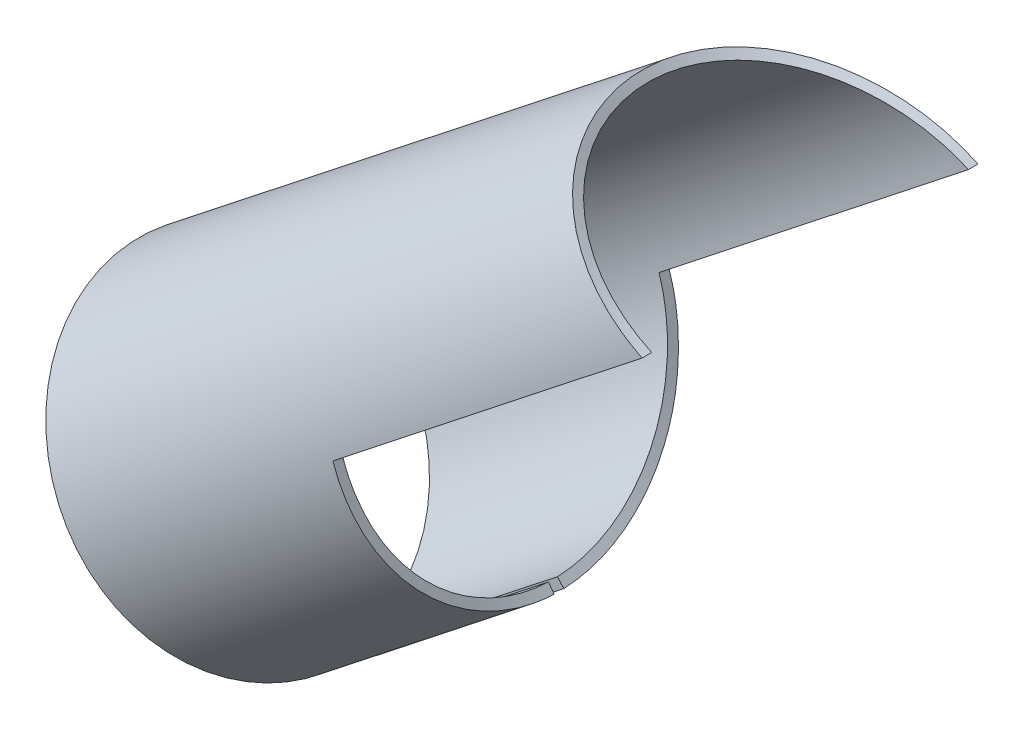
ISO-10303-21;
HEADER;
FILE_DESCRIPTION(('STEP AP214'),'2;1');
FILE_NAME('part.step','',(''),(''),'','','');
FILE_SCHEMA(('AUTOMOTIVE_DESIGN { 1 0 10303 214 1 1 1 1 }'));
ENDSEC;
DATA;
#1=APPLICATION_CONTEXT('core data for automotive mechanical design processes');
#2=APPLICATION_PROTOCOL_DEFINITION('international standard','automotive_design',2000,#1);
#3=PRODUCT_CONTEXT('',#1,'mechanical');
#4=PRODUCT('Part','Part','',(#3));
#5=PRODUCT_RELATED_PRODUCT_CATEGORY('part','',(#4));
#6=PRODUCT_DEFINITION_FORMATION('','',#4);
#7=PRODUCT_DEFINITION_CONTEXT('part definition',#1,'design');
#8=PRODUCT_DEFINITION('design','',#6,#7);
#9=PRODUCT_DEFINITION_SHAPE('','',#8);
#10=(LENGTH_UNIT() NAMED_UNIT(*) SI_UNIT(.MILLI.,.METRE.));
#11=(NAMED_UNIT(*) PLANE_ANGLE_UNIT() SI_UNIT($,.RADIAN.));
#12=(NAMED_UNIT(*) SI_UNIT($,.STERADIAN.) SOLID_ANGLE_UNIT());
#13=UNCERTAINTY_MEASURE_WITH_UNIT(LENGTH_MEASURE(1.E-05),#10,'distance_accuracy_value','');
#14=(GEOMETRIC_REPRESENTATION_CONTEXT(3) GLOBAL_UNCERTAINTY_ASSIGNED_CONTEXT((#13)) GLOBAL_UNIT_ASSIGNED_CONTEXT((#10,
#11,#12)) REPRESENTATION_CONTEXT('',''));
#15=CARTESIAN_POINT('',(0.,0.,0.));
#16=DIRECTION('',(0.,0.,1.));
#17=DIRECTION('',(1.,0.,0.));
#18=AXIS2_PLACEMENT_3D('',#15,#16,#17);
#19=CARTESIAN_POINT('',(-32.2001960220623,-25.3800586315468,17.4844566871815));
#20=CARTESIAN_POINT('',(-31.9485705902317,-26.1057741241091,17.4844566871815));
#21=CARTESIAN_POINT('',(-31.7282094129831,-26.7402730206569,17.439976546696));
#22=CARTESIAN_POINT('',(-31.4463114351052,-27.5534036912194,17.3509718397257));
#23=CARTESIAN_POINT('',(-31.360405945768,-27.8013801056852,17.3174602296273));
#24=CARTESIAN_POINT('',(-31.2435000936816,-28.138919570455,17.2657864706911));
#25=CARTESIAN_POINT('',(-31.2065217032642,-28.2456975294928,17.2483190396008));
#26=CARTESIAN_POINT('',(-31.1540097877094,-28.397299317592,17.2222224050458));
#27=CARTESIAN_POINT('',(-31.1369983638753,-28.44640580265,17.2135404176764));
#28=CARTESIAN_POINT('',(-31.1122158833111,-28.5179296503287,17.2005966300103));
#29=CARTESIAN_POINT('',(-31.1040774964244,-28.5414149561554,17.19629520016));
#30=CARTESIAN_POINT('',(-31.0920530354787,-28.5761096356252,17.1898692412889));
#31=CARTESIAN_POINT('',(-31.0880754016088,-28.5875856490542,17.1877316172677));
#32=CARTESIAN_POINT('',(-31.0821546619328,-28.604666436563,17.1845325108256));
#33=CARTESIAN_POINT('',(-31.0801887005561,-28.610337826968,17.183467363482));
#34=CARTESIAN_POINT('',(-31.0772511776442,-28.6188116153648,17.1818715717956));
#35=CARTESIAN_POINT('',(-31.076273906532,-28.6216306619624,17.1813399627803));
#36=CARTESIAN_POINT('',(-31.074810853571,-28.6258509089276,17.1805430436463));
#37=CARTESIAN_POINT('',(-31.0743236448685,-28.6272562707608,17.1802774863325));
#38=CARTESIAN_POINT('',(-31.073350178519,-28.6300642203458,17.1797465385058));
#39=CARTESIAN_POINT('',(-31.0731781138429,-28.6305605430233,17.1796527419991));
#40=CARTESIAN_POINT('',(-30.8675844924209,-29.2235792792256,17.0673694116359));
#41=CARTESIAN_POINT('',(-30.6738364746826,-29.7819389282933,16.9301137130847));
#42=CARTESIAN_POINT('',(-30.4005761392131,-30.5699445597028,16.6986564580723));
#43=CARTESIAN_POINT('',(-30.31236897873,-30.8243752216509,16.6172291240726));
#44=CARTESIAN_POINT('',(-30.184365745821,-31.1936795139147,16.4901208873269));
#45=CARTESIAN_POINT('',(-30.1424152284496,-31.3147248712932,16.4469227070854));
#46=CARTESIAN_POINT('',(-30.0805580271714,-31.4932180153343,16.3810546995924));
#47=CARTESIAN_POINT('',(-30.0601170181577,-31.5522032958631,16.3589201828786));
#48=CARTESIAN_POINT('',(-30.0297213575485,-31.6399141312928,16.3254716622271));
#49=CARTESIAN_POINT('',(-30.019633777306,-31.6690232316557,16.3142810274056));
#50=CARTESIAN_POINT('',(-30.0045686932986,-31.7124953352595,16.2974359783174));
#51=CARTESIAN_POINT('',(-29.9995580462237,-31.726954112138,16.2918111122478));
#52=CARTESIAN_POINT('',(-29.9920586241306,-31.7485944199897,16.2833593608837));
#53=CARTESIAN_POINT('',(-29.9895615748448,-31.7557998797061,16.2805397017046));
#54=CARTESIAN_POINT('',(-29.9858201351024,-31.7665961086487,16.2763066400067));
#55=CARTESIAN_POINT('',(-29.9845736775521,-31.7701928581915,16.2748950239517));
#56=CARTESIAN_POINT('',(-29.9820821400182,-31.7773823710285,16.2720706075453));
#57=CARTESIAN_POINT('',(-29.9811256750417,-31.7801423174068,16.2709856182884));
#58=CARTESIAN_POINT('',(-29.5871430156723,-32.9170042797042,15.8234971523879));
#59=CARTESIAN_POINT('',(-29.2276328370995,-33.9511560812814,15.2795627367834));
#60=CARTESIAN_POINT('',(-28.7432525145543,-35.3480067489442,14.3751005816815));
#61=CARTESIAN_POINT('',(-28.5908186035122,-35.788048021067,14.0587869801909));
#62=CARTESIAN_POINT('',(-28.3754478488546,-36.4100753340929,13.568678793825));
#63=CARTESIAN_POINT('',(-28.30586519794,-36.6110859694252,13.4026972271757));
#64=CARTESIAN_POINT('',(-28.2047229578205,-36.9032052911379,13.1505763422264));
#65=CARTESIAN_POINT('',(-28.1715471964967,-36.999012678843,13.0660108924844));
#66=CARTESIAN_POINT('',(-28.1225784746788,-37.1403911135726,12.9384675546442));
#67=CARTESIAN_POINT('',(-28.1063880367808,-37.1871285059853,12.8958372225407));
#68=CARTESIAN_POINT('',(-28.0822993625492,-37.2566536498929,12.8317292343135));
#69=CARTESIAN_POINT('',(-28.074302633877,-37.2797318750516,12.8103328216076));
#70=CARTESIAN_POINT('',(-28.0623565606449,-37.3142042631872,12.7781989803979));
#71=CARTESIAN_POINT('',(-28.058382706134,-37.325670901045,12.7674811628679));
#72=CARTESIAN_POINT('',(-28.0524341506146,-37.34283465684,12.7513948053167));
#73=CARTESIAN_POINT('',(-28.0504533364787,-37.3485498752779,12.7460310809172));
#74=CARTESIAN_POINT('',(-28.0474851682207,-37.3571136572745,12.7379831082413));
#75=CARTESIAN_POINT('',(-28.0464962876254,-37.3599667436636,12.7353000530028));
#76=CARTESIAN_POINT('',(-28.0445195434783,-37.3656699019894,12.7299331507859));
#77=CARTESIAN_POINT('',(-28.0437139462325,-37.3679941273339,12.7277448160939));
#78=CARTESIAN_POINT('',(-27.7431211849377,-38.2352179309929,11.910548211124));
#79=CARTESIAN_POINT('',(-27.4786236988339,-38.9964193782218,11.0264099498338));
#80=CARTESIAN_POINT('',(-27.1375093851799,-39.9801346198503,9.63621673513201));
#81=CARTESIAN_POINT('',(-27.0330077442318,-40.2817792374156,9.16212414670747));
#82=CARTESIAN_POINT('',(-26.8899021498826,-40.6950557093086,8.43973407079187));
#83=CARTESIAN_POINT('',(-26.8444711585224,-40.826287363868,8.19705924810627));
#84=CARTESIAN_POINT('',(-26.7796806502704,-41.0134079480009,7.8308003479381));
#85=CARTESIAN_POINT('',(-26.7586429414,-41.0741605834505,7.70833939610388));
#86=CARTESIAN_POINT('',(-26.7279170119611,-41.1628684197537,7.52415538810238));
#87=CARTESIAN_POINT('',(-26.7178134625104,-41.1920341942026,7.46267860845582));
#88=CARTESIAN_POINT('',(-26.7028646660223,-41.2351790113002,7.37034882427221));
#89=CARTESIAN_POINT('',(-26.6979161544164,-41.2494599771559,7.33955312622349));
#90=CARTESIAN_POINT('',(-26.6905448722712,-41.270730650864,7.29333198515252));
#91=CARTESIAN_POINT('',(-26.6880963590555,-41.2777957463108,7.27792033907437));
#92=CARTESIAN_POINT('',(-26.684436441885,-41.2883557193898,7.25479610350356));
#93=CARTESIAN_POINT('',(-26.6832186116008,-41.2918694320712,7.24708689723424));
#94=CARTESIAN_POINT('',(-26.6807872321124,-41.2988843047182,7.23166625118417));
#95=CARTESIAN_POINT('',(-26.6796643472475,-41.3021239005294,7.22453203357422));
#96=CARTESIAN_POINT('',(-26.5950294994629,-41.5462931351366,6.68569713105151));
#97=CARTESIAN_POINT('',(-26.5212786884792,-41.7589115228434,6.1458410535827));
#98=CARTESIAN_POINT('',(-26.4252386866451,-42.0358769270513,5.32657283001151));
#99=CARTESIAN_POINT('',(-26.3956532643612,-42.1212089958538,5.05190181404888));
#100=CARTESIAN_POINT('',(-26.3549162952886,-42.2387233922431,4.63807284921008));
#101=CARTESIAN_POINT('',(-26.3419439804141,-42.2761478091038,4.49982603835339));
#102=CARTESIAN_POINT('',(-26.3233937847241,-42.3296660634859,4.29206803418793));
#103=CARTESIAN_POINT('',(-26.3173617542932,-42.347069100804,4.22275072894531));
#104=CARTESIAN_POINT('',(-26.3085404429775,-42.372519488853,4.11868625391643));
#105=CARTESIAN_POINT('',(-26.305637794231,-42.3808939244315,4.08398334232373));
#106=CARTESIAN_POINT('',(-26.2999080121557,-42.3974248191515,4.01454941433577));
#107=CARTESIAN_POINT('',(-26.297134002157,-42.4054280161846,3.98048009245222));
#108=CARTESIAN_POINT('',(-26.2715512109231,-42.4792349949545,3.66182551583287));
#109=CARTESIAN_POINT('',(-26.2513011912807,-42.5376548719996,3.37745368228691));
#110=CARTESIAN_POINT('',(-26.2246572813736,-42.6145105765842,2.94976334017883));
#111=CARTESIAN_POINT('',(-26.2163976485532,-42.6383336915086,2.8070110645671));
#112=CARTESIAN_POINT('',(-26.2049385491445,-42.6713779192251,2.59266783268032));
#113=CARTESIAN_POINT('',(-26.2012738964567,-42.6819442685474,2.5211842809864));
#114=CARTESIAN_POINT('',(-26.194254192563,-42.702180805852,2.37815690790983));
#115=CARTESIAN_POINT('',(-26.1909299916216,-42.7117620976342,2.30730293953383));
#116=CARTESIAN_POINT('',(-26.1812358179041,-42.739696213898,2.09052846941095));
#117=CARTESIAN_POINT('',(-26.1754252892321,-42.7564793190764,1.94610458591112));
#118=CARTESIAN_POINT('',(-26.1676700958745,-42.7789170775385,1.72967904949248));
#119=CARTESIAN_POINT('',(-26.1652451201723,-42.7859401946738,1.65757223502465));
#120=CARTESIAN_POINT('',(-26.1618454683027,-42.7957936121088,1.54947335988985));
#121=CARTESIAN_POINT('',(-26.1607518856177,-42.7989645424,1.51345062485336));
#122=CARTESIAN_POINT('',(-26.1591706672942,-42.8035510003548,1.4594329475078));
#123=CARTESIAN_POINT('',(-26.1586534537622,-42.805051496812,1.44142979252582));
#124=CARTESIAN_POINT('',(-26.1578923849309,-42.8072598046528,1.41442930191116));
#125=CARTESIAN_POINT('',(-26.1576411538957,-42.8079888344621,1.40542984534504));
#126=CARTESIAN_POINT('',(-26.157267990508,-42.8090717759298,1.39193173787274));
#127=CARTESIAN_POINT('',(-26.1571442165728,-42.8094309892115,1.38743254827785));
#128=CARTESIAN_POINT('',(-26.1569594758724,-42.8099671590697,1.38068403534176));
#129=CARTESIAN_POINT('',(-26.156898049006,-42.8101454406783,1.37843457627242));
#130=CARTESIAN_POINT('',(-26.156775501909,-42.8105011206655,1.37393574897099));
#131=CARTESIAN_POINT('',(-26.1566989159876,-42.8107234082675,1.37111578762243));
#132=CARTESIAN_POINT('',(-26.1508292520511,-42.8277601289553,1.15455967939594));
#133=CARTESIAN_POINT('',(-26.1431223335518,-42.8461852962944,0.86485712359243));
#134=CARTESIAN_POINT('',(-26.1404437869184,-42.8573646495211,0.499999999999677));
#135=CARTESIAN_POINT('',(-32.2001960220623,-25.3800586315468,16.4844566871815));
#136=CARTESIAN_POINT('',(-31.9742648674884,-26.073174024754,16.4844566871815));
#137=CARTESIAN_POINT('',(-31.7763750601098,-26.6791642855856,16.442520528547));
#138=CARTESIAN_POINT('',(-31.5232647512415,-27.4557714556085,16.3586063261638));
#139=CARTESIAN_POINT('',(-31.446137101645,-27.6926112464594,16.3270113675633));
#140=CARTESIAN_POINT('',(-31.3411788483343,-28.0149925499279,16.2782930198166));
#141=CARTESIAN_POINT('',(-31.3079799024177,-28.1169754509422,16.2618246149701));
#142=CARTESIAN_POINT('',(-31.260834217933,-28.2617689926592,16.237220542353));
#143=CARTESIAN_POINT('',(-31.2455610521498,-28.3086701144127,16.229035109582));
#144=CARTESIAN_POINT('',(-31.2233104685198,-28.3769816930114,16.2168316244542));
#145=CARTESIAN_POINT('',(-31.2160034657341,-28.3994122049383,16.2127762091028));
#146=CARTESIAN_POINT('',(-31.2052072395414,-28.4325485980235,16.2067177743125));
#147=CARTESIAN_POINT('',(-31.2016358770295,-28.4435091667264,16.204702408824));
#148=CARTESIAN_POINT('',(-31.1963198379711,-28.4598227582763,16.201686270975));
#149=CARTESIAN_POINT('',(-31.194554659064,-28.4652394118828,16.2006820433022));
#150=CARTESIAN_POINT('',(-31.1919171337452,-28.4733325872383,16.1991775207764));
#151=CARTESIAN_POINT('',(-31.1910396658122,-28.4760250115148,16.1986763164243));
#152=CARTESIAN_POINT('',(-31.189726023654,-28.4800556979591,16.197924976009));
#153=CARTESIAN_POINT('',(-31.1892885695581,-28.4813979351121,16.1976746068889));
#154=CARTESIAN_POINT('',(-31.1884145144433,-28.4840797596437,16.1971740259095));
#155=CARTESIAN_POINT('',(-31.1882600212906,-28.4845537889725,16.1970855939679));
#156=CARTESIAN_POINT('',(-31.003661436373,-29.0509356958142,16.0912241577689));
#157=CARTESIAN_POINT('',(-30.8296851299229,-29.5842105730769,15.9618186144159));
#158=CARTESIAN_POINT('',(-30.5843245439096,-30.3368192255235,15.7435992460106));
#159=CARTESIAN_POINT('',(-30.5051251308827,-30.5798215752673,15.6668290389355));
#160=CARTESIAN_POINT('',(-30.3901959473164,-30.93253855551,15.5469905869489));
#161=CARTESIAN_POINT('',(-30.3525305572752,-31.0481472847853,15.5062630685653));
#162=CARTESIAN_POINT('',(-30.2969921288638,-31.2186236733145,15.4441622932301));
#163=CARTESIAN_POINT('',(-30.2786392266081,-31.2749597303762,15.4232937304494));
#164=CARTESIAN_POINT('',(-30.2513485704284,-31.3587311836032,15.3917582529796));
#165=CARTESIAN_POINT('',(-30.2422914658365,-31.3865328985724,15.3812076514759));
#166=CARTESIAN_POINT('',(-30.2287653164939,-31.428052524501,15.3653260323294));
#167=CARTESIAN_POINT('',(-30.2242665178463,-31.4418619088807,15.3600228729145));
#168=CARTESIAN_POINT('',(-30.217533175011,-31.462530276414,15.35205450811));
#169=CARTESIAN_POINT('',(-30.2152912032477,-31.4694121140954,15.3493961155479));
#170=CARTESIAN_POINT('',(-30.2119319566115,-31.4797234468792,15.3454051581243));
#171=CARTESIAN_POINT('',(-30.2108128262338,-31.4831586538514,15.3440742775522));
#172=CARTESIAN_POINT('',(-30.2085758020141,-31.4900252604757,15.341411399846));
#173=CARTESIAN_POINT('',(-30.2077170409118,-31.4926612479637,15.3403884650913));
#174=CARTESIAN_POINT('',(-29.8539800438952,-32.5784627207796,14.9184935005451));
#175=CARTESIAN_POINT('',(-29.5311041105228,-33.5661359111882,14.4056686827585));
#176=CARTESIAN_POINT('',(-29.0961797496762,-34.9002407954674,13.552936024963));
#177=CARTESIAN_POINT('',(-28.9593221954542,-35.3205200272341,13.254713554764));
#178=CARTESIAN_POINT('',(-28.7659673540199,-35.9146153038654,12.7926364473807));
#179=CARTESIAN_POINT('',(-28.7034988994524,-36.106600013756,12.6361479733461));
#180=CARTESIAN_POINT('',(-28.6126958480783,-36.3856017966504,12.3984468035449));
#181=CARTESIAN_POINT('',(-28.5829111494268,-36.4771068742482,12.3187179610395));
#182=CARTESIAN_POINT('',(-28.5389467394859,-36.6121362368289,12.1984692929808));
#183=CARTESIAN_POINT('',(-28.5244106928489,-36.6567746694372,12.158277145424));
#184=CARTESIAN_POINT('',(-28.5027831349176,-36.7231773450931,12.0978357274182));
#185=CARTESIAN_POINT('',(-28.4956033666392,-36.7452190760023,12.0776630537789));
#186=CARTESIAN_POINT('',(-28.4848776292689,-36.778143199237,12.0473670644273));
#187=CARTESIAN_POINT('',(-28.4813097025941,-36.7890948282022,12.0372622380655));
#188=CARTESIAN_POINT('',(-28.4759687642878,-36.8054876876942,12.0220959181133));
#189=CARTESIAN_POINT('',(-28.4741902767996,-36.8109462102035,12.0170389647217));
#190=CARTESIAN_POINT('',(-28.4715252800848,-36.8191253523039,12.009451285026));
#191=CARTESIAN_POINT('',(-28.4706374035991,-36.821850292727,12.0069216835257));
#192=CARTESIAN_POINT('',(-28.4688625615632,-36.8272972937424,12.0018617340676));
#193=CARTESIAN_POINT('',(-28.4681392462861,-36.8295171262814,11.9997985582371));
#194=CARTESIAN_POINT('',(-28.1982479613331,-37.6577893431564,11.2293404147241));
#195=CARTESIAN_POINT('',(-27.9607128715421,-38.3847830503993,10.3957692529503));
#196=CARTESIAN_POINT('',(-27.6544272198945,-39.3243104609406,9.08508627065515));
#197=CARTESIAN_POINT('',(-27.5606032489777,-39.6124081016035,8.63810877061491));
#198=CARTESIAN_POINT('',(-27.4321253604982,-40.0071261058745,7.95703482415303));
#199=CARTESIAN_POINT('',(-27.3913390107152,-40.1324650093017,7.72823946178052));
#200=CARTESIAN_POINT('',(-27.3331714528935,-40.3111829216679,7.38292824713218));
#201=CARTESIAN_POINT('',(-27.3142840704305,-40.3692073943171,7.2674712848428));
#202=CARTESIAN_POINT('',(-27.2866981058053,-40.4539314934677,7.09382143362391));
#203=CARTESIAN_POINT('',(-27.277626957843,-40.4817874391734,7.03586073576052));
#204=CARTESIAN_POINT('',(-27.2642054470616,-40.5229945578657,6.94881162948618));
#205=CARTESIAN_POINT('',(-27.2597624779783,-40.5366341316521,6.91977724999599));
#206=CARTESIAN_POINT('',(-27.2531441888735,-40.5569494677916,6.87619966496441));
#207=CARTESIAN_POINT('',(-27.2509457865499,-40.5636972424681,6.86166946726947));
#208=CARTESIAN_POINT('',(-27.247659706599,-40.5737829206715,6.83986779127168));
#209=CARTESIAN_POINT('',(-27.2465662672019,-40.5771388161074,6.83259950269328));
#210=CARTESIAN_POINT('',(-27.2443832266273,-40.583838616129,6.81806081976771));
#211=CARTESIAN_POINT('',(-27.2433750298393,-40.586932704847,6.81133463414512));
#212=CARTESIAN_POINT('',(-27.1673843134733,-40.820134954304,6.30331766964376));
#213=CARTESIAN_POINT('',(-27.1011618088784,-41.0232020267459,5.79433793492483));
#214=CARTESIAN_POINT('',(-27.0149278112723,-41.2877263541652,5.02192665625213));
#215=CARTESIAN_POINT('',(-26.9883634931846,-41.3692254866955,4.76296507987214));
#216=CARTESIAN_POINT('',(-26.9517868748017,-41.4814615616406,4.37280450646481));
#217=CARTESIAN_POINT('',(-26.9401394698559,-41.5172050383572,4.24246453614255));
#218=CARTESIAN_POINT('',(-26.9234839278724,-41.5683195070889,4.04658897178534));
#219=CARTESIAN_POINT('',(-26.9180679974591,-41.5849408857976,3.98123617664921));
#220=CARTESIAN_POINT('',(-26.9101476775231,-41.6092481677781,3.88312352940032));
#221=CARTESIAN_POINT('',(-26.9075414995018,-41.6172464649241,3.85040540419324));
#222=CARTESIAN_POINT('',(-26.9023969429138,-41.6330348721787,3.78494265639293));
#223=CARTESIAN_POINT('',(-26.89990626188,-41.6406786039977,3.75282188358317));
#224=CARTESIAN_POINT('',(-26.8769363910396,-41.7111705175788,3.45239232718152));
#225=CARTESIAN_POINT('',(-26.8587545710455,-41.7669664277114,3.18428475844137));
#226=CARTESIAN_POINT('',(-26.8348316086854,-41.8403700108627,2.78105559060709));
#227=CARTESIAN_POINT('',(-26.8274154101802,-41.8631230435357,2.64646783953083));
#228=CARTESIAN_POINT('',(-26.8171262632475,-41.8946829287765,2.44438368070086));
#229=CARTESIAN_POINT('',(-26.8138357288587,-41.904774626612,2.37698853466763));
#230=CARTESIAN_POINT('',(-26.8075325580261,-41.9241020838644,2.24214141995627));
#231=CARTESIAN_POINT('',(-26.8045476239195,-41.9332529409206,2.17533984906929));
#232=CARTESIAN_POINT('',(-26.7958426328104,-41.9599320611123,1.9709635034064));
#233=CARTESIAN_POINT('',(-26.7906261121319,-41.9759615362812,1.83479974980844));
#234=CARTESIAN_POINT('',(-26.7836647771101,-41.9973921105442,1.63075238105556));
#235=CARTESIAN_POINT('',(-26.7814882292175,-42.0041000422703,1.56276961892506));
#236=CARTESIAN_POINT('',(-26.7784370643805,-42.0135113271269,1.46085331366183));
#237=CARTESIAN_POINT('',(-26.7774556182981,-42.0165399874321,1.4268908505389));
#238=CARTESIAN_POINT('',(-26.7760365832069,-42.020920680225,1.37596264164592));
#239=CARTESIAN_POINT('',(-26.7755724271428,-42.0223538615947,1.35898915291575));
#240=CARTESIAN_POINT('',(-26.774889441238,-42.0244631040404,1.33353291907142));
#241=CARTESIAN_POINT('',(-26.7746639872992,-42.0251594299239,1.32504817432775));
#242=CARTESIAN_POINT('',(-26.7743291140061,-42.0261937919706,1.31232207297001));
#243=CARTESIAN_POINT('',(-26.7742180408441,-42.0265368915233,1.30808020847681));
#244=CARTESIAN_POINT('',(-26.7740522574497,-42.0270490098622,1.30171766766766));
#245=CARTESIAN_POINT('',(-26.773997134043,-42.0272192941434,1.29959686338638));
#246=CARTESIAN_POINT('',(-26.7738871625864,-42.0275590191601,1.29535534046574));
#247=CARTESIAN_POINT('',(-26.7738184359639,-42.0277713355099,1.29269666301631));
#248=CARTESIAN_POINT('',(-26.768551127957,-42.0440438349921,1.08852619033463));
#249=CARTESIAN_POINT('',(-26.7615254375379,-42.0616047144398,0.815392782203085));
#250=CARTESIAN_POINT('',(-26.7592164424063,-42.072315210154,0.47140317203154));
#251=B_SPLINE_SURFACE_WITH_KNOTS('',1,3,((#19,#20,#21,#22,#23,#24,#25,#26,#27,#28,#29,#30,#31,
#32,#33,#34,#35,#36,#37,#38,#39,#40,#41,#42,#43,#44,#45,#46,#47,#48,#49,#50,#51,#52,#53,#54,#55,
#56,#57,#58,#59,#60,#61,#62,#63,#64,#65,#66,#67,#68,#69,#70,#71,#72,#73,#74,#75,#76,#77,#78,#79,
#80,#81,#82,#83,#84,#85,#86,#87,#88,#89,#90,#91,#92,#93,#94,#95,#96,#97,#98,#99,#100,#101,#102,
#103,#104,#105,#106,#107,#108,#109,#110,#111,#112,#113,#114,#115,#116,#117,#118,#119,#120,#121,
#122,#123,#124,#125,#126,#127,#128,#129,#130,#131,#132,#133,#134),(#135,#136,#137,#138,#139,
#140,#141,#142,#143,#144,#145,#146,#147,#148,#149,#150,#151,#152,#153,#154,#155,#156,#157,#158,
#159,#160,#161,#162,#163,#164,#165,#166,#167,#168,#169,#170,#171,#172,#173,#174,#175,#176,#177,
#178,#179,#180,#181,#182,#183,#184,#185,#186,#187,#188,#189,#190,#191,#192,#193,#194,#195,#196,
#197,#198,#199,#200,#201,#202,#203,#204,#205,#206,#207,#208,#209,#210,#211,#212,#213,#214,#215,
#216,#217,#218,#219,#220,#221,#222,#223,#224,#225,#226,#227,#228,#229,#230,#231,#232,#233,#234,
#235,#236,#237,#238,#239,#240,#241,#242,#243,#244,#245,#246,#247,#248,#249,#250)),.UNSPECIFIED.,
.F.,.F.,.F.,(2,2),(4,2,2,2,2,2,2,2,2,2,2,2,2,2,2,2,2,2,2,2,2,2,2,2,2,2,2,2,2,2,2,2,2,2,2,2,2,2,
2,2,2,2,2,2,2,2,2,2,2,2,2,2,2,2,2,2,2,4),(0.,1.),(0.,0.0625,0.09375,0.109375,0.1171875,
0.12109375,0.123046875,0.1240234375,0.12451171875,0.124755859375,0.125,0.1875,0.21875,0.234375,
0.2421875,0.24609375,0.248046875,0.2490234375,0.24951171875,0.25,0.375,0.4375,0.46875,0.484375,
0.4921875,0.49609375,0.498046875,0.4990234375,0.49951171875,0.5,0.625,0.6875,0.71875,0.734375,
0.7421875,0.74609375,0.748046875,0.7490234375,0.75,0.8125,0.84375,0.859375,0.8671875,0.87109375,
0.875,0.90625,0.921875,0.9296875,0.9375,0.953125,0.9609375,0.96484375,0.966796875,0.9677734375,
0.96826171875,0.968505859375,0.96875,1.),.UNSPECIFIED.);
#252=CARTESIAN_POINT('',(-26.1404437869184,-42.8573646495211,0.499999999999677));
#253=CARTESIAN_POINT('',(-26.7592164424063,-42.072315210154,0.47140317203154));
#254=B_SPLINE_CURVE_WITH_KNOTS('',1,(#252,#253),.UNSPECIFIED.,.F.,.F.,(2,2),(0.,1.),.UNSPECIFIED.);
#255=CARTESIAN_POINT('',(-26.7592164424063,-42.072315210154,0.47140317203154));
#256=VERTEX_POINT('',#255);
#257=CARTESIAN_POINT('',(-26.1404437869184,-42.8573646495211,0.499999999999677));
#258=VERTEX_POINT('',#257);
#259=EDGE_CURVE('E13',#256,#258,#254,.F.);
#260=CARTESIAN_POINT('',(-26.7592164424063,-42.072315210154,0.47140317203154));
#261=CARTESIAN_POINT('',(-26.7615254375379,-42.0616047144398,0.815392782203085));
#262=CARTESIAN_POINT('',(-26.768551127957,-42.0440438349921,1.08852619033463));
#263=CARTESIAN_POINT('',(-26.7738184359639,-42.0277713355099,1.29269666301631));
#264=CARTESIAN_POINT('',(-26.7738871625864,-42.0275590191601,1.29535534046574));
#265=CARTESIAN_POINT('',(-26.773997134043,-42.0272192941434,1.29959686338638));
#266=CARTESIAN_POINT('',(-26.7740522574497,-42.0270490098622,1.30171766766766));
#267=CARTESIAN_POINT('',(-26.7742180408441,-42.0265368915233,1.30808020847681));
#268=CARTESIAN_POINT('',(-26.7743291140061,-42.0261937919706,1.31232207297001));
#269=CARTESIAN_POINT('',(-26.7746639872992,-42.0251594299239,1.32504817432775));
#270=CARTESIAN_POINT('',(-26.774889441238,-42.0244631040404,1.33353291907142));
#271=CARTESIAN_POINT('',(-26.7755724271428,-42.0223538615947,1.35898915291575));
#272=CARTESIAN_POINT('',(-26.7760365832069,-42.020920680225,1.37596264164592));
#273=CARTESIAN_POINT('',(-26.7774556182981,-42.0165399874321,1.4268908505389));
#274=CARTESIAN_POINT('',(-26.7784370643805,-42.0135113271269,1.46085331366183));
#275=CARTESIAN_POINT('',(-26.7814882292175,-42.0041000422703,1.56276961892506));
#276=CARTESIAN_POINT('',(-26.7836647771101,-41.9973921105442,1.63075238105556));
#277=CARTESIAN_POINT('',(-26.7906261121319,-41.9759615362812,1.83479974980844));
#278=CARTESIAN_POINT('',(-26.7958426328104,-41.9599320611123,1.9709635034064));
#279=CARTESIAN_POINT('',(-26.8045476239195,-41.9332529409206,2.17533984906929));
#280=CARTESIAN_POINT('',(-26.8075325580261,-41.9241020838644,2.24214141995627));
#281=CARTESIAN_POINT('',(-26.8138357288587,-41.904774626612,2.37698853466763));
#282=CARTESIAN_POINT('',(-26.8171262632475,-41.8946829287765,2.44438368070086));
#283=CARTESIAN_POINT('',(-26.8274154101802,-41.8631230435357,2.64646783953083));
#284=CARTESIAN_POINT('',(-26.8348316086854,-41.8403700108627,2.78105559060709));
#285=CARTESIAN_POINT('',(-26.8587545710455,-41.7669664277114,3.18428475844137));
#286=CARTESIAN_POINT('',(-26.8769363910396,-41.7111705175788,3.45239232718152));
#287=CARTESIAN_POINT('',(-26.89990626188,-41.6406786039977,3.75282188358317));
#288=CARTESIAN_POINT('',(-26.9023969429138,-41.6330348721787,3.78494265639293));
#289=CARTESIAN_POINT('',(-26.9075414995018,-41.6172464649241,3.85040540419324));
#290=CARTESIAN_POINT('',(-26.9101476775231,-41.6092481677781,3.88312352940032));
#291=CARTESIAN_POINT('',(-26.9180679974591,-41.5849408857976,3.98123617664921));
#292=CARTESIAN_POINT('',(-26.9234839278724,-41.5683195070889,4.04658897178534));
#293=CARTESIAN_POINT('',(-26.9401394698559,-41.5172050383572,4.24246453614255));
#294=CARTESIAN_POINT('',(-26.9517868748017,-41.4814615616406,4.37280450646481));
#295=CARTESIAN_POINT('',(-26.9883634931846,-41.3692254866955,4.76296507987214));
#296=CARTESIAN_POINT('',(-27.0149278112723,-41.2877263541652,5.02192665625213));
#297=CARTESIAN_POINT('',(-27.1011618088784,-41.0232020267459,5.79433793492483));
#298=CARTESIAN_POINT('',(-27.1673843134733,-40.820134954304,6.30331766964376));
#299=CARTESIAN_POINT('',(-27.2433750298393,-40.586932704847,6.81133463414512));
#300=CARTESIAN_POINT('',(-27.2443832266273,-40.583838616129,6.81806081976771));
#301=CARTESIAN_POINT('',(-27.2465662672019,-40.5771388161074,6.83259950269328));
#302=CARTESIAN_POINT('',(-27.247659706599,-40.5737829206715,6.83986779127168));
#303=CARTESIAN_POINT('',(-27.2509457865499,-40.5636972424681,6.86166946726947));
#304=CARTESIAN_POINT('',(-27.2531441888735,-40.5569494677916,6.87619966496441));
#305=CARTESIAN_POINT('',(-27.2597624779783,-40.5366341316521,6.91977724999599));
#306=CARTESIAN_POINT('',(-27.2642054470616,-40.5229945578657,6.94881162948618));
#307=CARTESIAN_POINT('',(-27.277626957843,-40.4817874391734,7.03586073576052));
#308=CARTESIAN_POINT('',(-27.2866981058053,-40.4539314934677,7.09382143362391));
#309=CARTESIAN_POINT('',(-27.3142840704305,-40.3692073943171,7.2674712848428));
#310=CARTESIAN_POINT('',(-27.3331714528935,-40.3111829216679,7.38292824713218));
#311=CARTESIAN_POINT('',(-27.3913390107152,-40.1324650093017,7.72823946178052));
#312=CARTESIAN_POINT('',(-27.4321253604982,-40.0071261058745,7.95703482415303));
#313=CARTESIAN_POINT('',(-27.5606032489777,-39.6124081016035,8.63810877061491));
#314=CARTESIAN_POINT('',(-27.6544272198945,-39.3243104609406,9.08508627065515));
#315=CARTESIAN_POINT('',(-27.9607128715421,-38.3847830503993,10.3957692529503));
#316=CARTESIAN_POINT('',(-28.1982479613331,-37.6577893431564,11.2293404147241));
#317=CARTESIAN_POINT('',(-28.4681392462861,-36.8295171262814,11.9997985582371));
#318=CARTESIAN_POINT('',(-28.4688625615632,-36.8272972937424,12.0018617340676));
#319=CARTESIAN_POINT('',(-28.4706374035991,-36.821850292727,12.0069216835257));
#320=CARTESIAN_POINT('',(-28.4715252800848,-36.8191253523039,12.009451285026));
#321=CARTESIAN_POINT('',(-28.4741902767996,-36.8109462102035,12.0170389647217));
#322=CARTESIAN_POINT('',(-28.4759687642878,-36.8054876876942,12.0220959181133));
#323=CARTESIAN_POINT('',(-28.4813097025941,-36.7890948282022,12.0372622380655));
#324=CARTESIAN_POINT('',(-28.4848776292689,-36.778143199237,12.0473670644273));
#325=CARTESIAN_POINT('',(-28.4956033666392,-36.7452190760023,12.0776630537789));
#326=CARTESIAN_POINT('',(-28.5027831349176,-36.7231773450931,12.0978357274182));
#327=CARTESIAN_POINT('',(-28.5244106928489,-36.6567746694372,12.158277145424));
#328=CARTESIAN_POINT('',(-28.5389467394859,-36.6121362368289,12.1984692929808));
#329=CARTESIAN_POINT('',(-28.5829111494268,-36.4771068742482,12.3187179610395));
#330=CARTESIAN_POINT('',(-28.6126958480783,-36.3856017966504,12.3984468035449));
#331=CARTESIAN_POINT('',(-28.7034988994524,-36.106600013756,12.6361479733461));
#332=CARTESIAN_POINT('',(-28.7659673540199,-35.9146153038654,12.7926364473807));
#333=CARTESIAN_POINT('',(-28.9593221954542,-35.3205200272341,13.254713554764));
#334=CARTESIAN_POINT('',(-29.0961797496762,-34.9002407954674,13.552936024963));
#335=CARTESIAN_POINT('',(-29.5311041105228,-33.5661359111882,14.4056686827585));
#336=CARTESIAN_POINT('',(-29.8539800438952,-32.5784627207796,14.9184935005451));
#337=CARTESIAN_POINT('',(-30.2077170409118,-31.4926612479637,15.3403884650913));
#338=CARTESIAN_POINT('',(-30.2085758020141,-31.4900252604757,15.341411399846));
#339=CARTESIAN_POINT('',(-30.2108128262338,-31.4831586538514,15.3440742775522));
#340=CARTESIAN_POINT('',(-30.2119319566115,-31.4797234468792,15.3454051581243));
#341=CARTESIAN_POINT('',(-30.2152912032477,-31.4694121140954,15.3493961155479));
#342=CARTESIAN_POINT('',(-30.217533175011,-31.462530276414,15.35205450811));
#343=CARTESIAN_POINT('',(-30.2242665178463,-31.4418619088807,15.3600228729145));
#344=CARTESIAN_POINT('',(-30.2287653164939,-31.428052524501,15.3653260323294));
#345=CARTESIAN_POINT('',(-30.2422914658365,-31.3865328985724,15.3812076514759));
#346=CARTESIAN_POINT('',(-30.2513485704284,-31.3587311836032,15.3917582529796));
#347=CARTESIAN_POINT('',(-30.2786392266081,-31.2749597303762,15.4232937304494));
#348=CARTESIAN_POINT('',(-30.2969921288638,-31.2186236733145,15.4441622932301));
#349=CARTESIAN_POINT('',(-30.3525305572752,-31.0481472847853,15.5062630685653));
#350=CARTESIAN_POINT('',(-30.3901959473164,-30.93253855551,15.5469905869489));
#351=CARTESIAN_POINT('',(-30.5051251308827,-30.5798215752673,15.6668290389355));
#352=CARTESIAN_POINT('',(-30.5843245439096,-30.3368192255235,15.7435992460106));
#353=CARTESIAN_POINT('',(-30.8296851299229,-29.5842105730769,15.9618186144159));
#354=CARTESIAN_POINT('',(-31.003661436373,-29.0509356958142,16.0912241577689));
#355=CARTESIAN_POINT('',(-31.1882600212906,-28.4845537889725,16.1970855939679));
#356=CARTESIAN_POINT('',(-31.1884145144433,-28.4840797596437,16.1971740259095));
#357=CARTESIAN_POINT('',(-31.1892885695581,-28.4813979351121,16.1976746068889));
#358=CARTESIAN_POINT('',(-31.189726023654,-28.4800556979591,16.197924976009));
#359=CARTESIAN_POINT('',(-31.1910396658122,-28.4760250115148,16.1986763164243));
#360=CARTESIAN_POINT('',(-31.1919171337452,-28.4733325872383,16.1991775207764));
#361=CARTESIAN_POINT('',(-31.194554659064,-28.4652394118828,16.2006820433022));
#362=CARTESIAN_POINT('',(-31.1963198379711,-28.4598227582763,16.201686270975));
#363=CARTESIAN_POINT('',(-31.2016358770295,-28.4435091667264,16.204702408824));
#364=CARTESIAN_POINT('',(-31.2052072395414,-28.4325485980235,16.2067177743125));
#365=CARTESIAN_POINT('',(-31.2160034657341,-28.3994122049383,16.2127762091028));
#366=CARTESIAN_POINT('',(-31.2233104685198,-28.3769816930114,16.2168316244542));
#367=CARTESIAN_POINT('',(-31.2455610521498,-28.3086701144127,16.229035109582));
#368=CARTESIAN_POINT('',(-31.260834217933,-28.2617689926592,16.237220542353));
#369=CARTESIAN_POINT('',(-31.3079799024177,-28.1169754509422,16.2618246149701));
#370=CARTESIAN_POINT('',(-31.3411788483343,-28.0149925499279,16.2782930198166));
#371=CARTESIAN_POINT('',(-31.446137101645,-27.6926112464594,16.3270113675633));
#372=CARTESIAN_POINT('',(-31.5232647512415,-27.4557714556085,16.3586063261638));
#373=CARTESIAN_POINT('',(-31.7763750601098,-26.6791642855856,16.442520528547));
#374=CARTESIAN_POINT('',(-31.9742648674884,-26.073174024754,16.4844566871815));
#375=CARTESIAN_POINT('',(-32.2001960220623,-25.3800586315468,16.4844566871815));
#376=B_SPLINE_CURVE_WITH_KNOTS('',3,(#260,#261,#262,#263,#264,#265,#266,#267,#268,#269,#270,
#271,#272,#273,#274,#275,#276,#277,#278,#279,#280,#281,#282,#283,#284,#285,#286,#287,#288,#289,
#290,#291,#292,#293,#294,#295,#296,#297,#298,#299,#300,#301,#302,#303,#304,#305,#306,#307,#308,
#309,#310,#311,#312,#313,#314,#315,#316,#317,#318,#319,#320,#321,#322,#323,#324,#325,#326,#327,
#328,#329,#330,#331,#332,#333,#334,#335,#336,#337,#338,#339,#340,#341,#342,#343,#344,#345,#346,
#347,#348,#349,#350,#351,#352,#353,#354,#355,#356,#357,#358,#359,#360,#361,#362,#363,#364,#365,
#366,#367,#368,#369,#370,#371,#372,#373,#374,#375),.UNSPECIFIED.,.F.,.F.,(4,2,2,2,2,2,2,2,2,2,2,
2,2,2,2,2,2,2,2,2,2,2,2,2,2,2,2,2,2,2,2,2,2,2,2,2,2,2,2,2,2,2,2,2,2,2,2,2,2,2,2,2,2,2,2,2,2,4),
(0.,0.03125,0.031494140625,0.03173828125,0.0322265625,0.033203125,0.03515625,0.0390625,0.046875,
0.0625,0.0703125,0.078125,0.09375,0.125,0.12890625,0.1328125,0.140625,0.15625,0.1875,0.25,
0.2509765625,0.251953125,0.25390625,0.2578125,0.265625,0.28125,0.3125,0.375,0.5,0.50048828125,
0.5009765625,0.501953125,0.50390625,0.5078125,0.515625,0.53125,0.5625,0.625,0.75,0.75048828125,
0.7509765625,0.751953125,0.75390625,0.7578125,0.765625,0.78125,0.8125,0.875,0.875244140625,
0.87548828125,0.8759765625,0.876953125,0.87890625,0.8828125,0.890625,0.90625,0.9375,1.),.UNSPECIFIED.);
#377=CARTESIAN_POINT('',(-32.2001960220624,-25.3800586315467,16.4844566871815));
#378=VERTEX_POINT('',#377);
#379=EDGE_CURVE('E216',#378,#256,#376,.F.);
#380=CARTESIAN_POINT('',(-32.2001960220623,-25.3800586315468,16.4844566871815));
#381=CARTESIAN_POINT('',(-32.2001960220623,-25.3800586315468,17.4844566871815));
#382=B_SPLINE_CURVE_WITH_KNOTS('',1,(#380,#381),.UNSPECIFIED.,.F.,.F.,(2,2),(0.,1.),.UNSPECIFIED.);
#383=CARTESIAN_POINT('',(-32.2001960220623,-25.3800586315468,17.4844566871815));
#384=VERTEX_POINT('',#383);
#385=EDGE_CURVE('E53',#378,#384,#382,.T.);
#386=CARTESIAN_POINT('',(-32.2001960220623,-25.3800586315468,17.4844566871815));
#387=CARTESIAN_POINT('',(-31.9485705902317,-26.1057741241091,17.4844566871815));
#388=CARTESIAN_POINT('',(-31.7282094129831,-26.7402730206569,17.439976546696));
#389=CARTESIAN_POINT('',(-31.4463114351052,-27.5534036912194,17.3509718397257));
#390=CARTESIAN_POINT('',(-31.360405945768,-27.8013801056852,17.3174602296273));
#391=CARTESIAN_POINT('',(-31.2435000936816,-28.138919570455,17.2657864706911));
#392=CARTESIAN_POINT('',(-31.2065217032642,-28.2456975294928,17.2483190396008));
#393=CARTESIAN_POINT('',(-31.1540097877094,-28.397299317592,17.2222224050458));
#394=CARTESIAN_POINT('',(-31.1369983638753,-28.44640580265,17.2135404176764));
#395=CARTESIAN_POINT('',(-31.1122158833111,-28.5179296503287,17.2005966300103));
#396=CARTESIAN_POINT('',(-31.1040774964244,-28.5414149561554,17.19629520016));
#397=CARTESIAN_POINT('',(-31.0920530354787,-28.5761096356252,17.1898692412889));
#398=CARTESIAN_POINT('',(-31.0880754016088,-28.5875856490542,17.1877316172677));
#399=CARTESIAN_POINT('',(-31.0821546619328,-28.604666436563,17.1845325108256));
#400=CARTESIAN_POINT('',(-31.0801887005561,-28.610337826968,17.183467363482));
#401=CARTESIAN_POINT('',(-31.0772511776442,-28.6188116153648,17.1818715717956));
#402=CARTESIAN_POINT('',(-31.076273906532,-28.6216306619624,17.1813399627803));
#403=CARTESIAN_POINT('',(-31.074810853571,-28.6258509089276,17.1805430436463));
#404=CARTESIAN_POINT('',(-31.0743236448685,-28.6272562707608,17.1802774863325));
#405=CARTESIAN_POINT('',(-31.073350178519,-28.6300642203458,17.1797465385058));
#406=CARTESIAN_POINT('',(-31.0731781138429,-28.6305605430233,17.1796527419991));
#407=CARTESIAN_POINT('',(-30.8675844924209,-29.2235792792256,17.0673694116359));
#408=CARTESIAN_POINT('',(-30.6738364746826,-29.7819389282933,16.9301137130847));
#409=CARTESIAN_POINT('',(-30.4005761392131,-30.5699445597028,16.6986564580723));
#410=CARTESIAN_POINT('',(-30.31236897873,-30.8243752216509,16.6172291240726));
#411=CARTESIAN_POINT('',(-30.184365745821,-31.1936795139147,16.4901208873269));
#412=CARTESIAN_POINT('',(-30.1424152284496,-31.3147248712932,16.4469227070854));
#413=CARTESIAN_POINT('',(-30.0805580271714,-31.4932180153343,16.3810546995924));
#414=CARTESIAN_POINT('',(-30.0601170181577,-31.5522032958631,16.3589201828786));
#415=CARTESIAN_POINT('',(-30.0297213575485,-31.6399141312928,16.3254716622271));
#416=CARTESIAN_POINT('',(-30.019633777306,-31.6690232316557,16.3142810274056));
#417=CARTESIAN_POINT('',(-30.0045686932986,-31.7124953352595,16.2974359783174));
#418=CARTESIAN_POINT('',(-29.9995580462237,-31.726954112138,16.2918111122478));
#419=CARTESIAN_POINT('',(-29.9920586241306,-31.7485944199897,16.2833593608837));
#420=CARTESIAN_POINT('',(-29.9895615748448,-31.7557998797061,16.2805397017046));
#421=CARTESIAN_POINT('',(-29.9858201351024,-31.7665961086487,16.2763066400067));
#422=CARTESIAN_POINT('',(-29.9845736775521,-31.7701928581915,16.2748950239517));
#423=CARTESIAN_POINT('',(-29.9820821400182,-31.7773823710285,16.2720706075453));
#424=CARTESIAN_POINT('',(-29.9811256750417,-31.7801423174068,16.2709856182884));
#425=CARTESIAN_POINT('',(-29.5871430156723,-32.9170042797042,15.8234971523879));
#426=CARTESIAN_POINT('',(-29.2276328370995,-33.9511560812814,15.2795627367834));
#427=CARTESIAN_POINT('',(-28.7432525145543,-35.3480067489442,14.3751005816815));
#428=CARTESIAN_POINT('',(-28.5908186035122,-35.788048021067,14.0587869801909));
#429=CARTESIAN_POINT('',(-28.3754478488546,-36.4100753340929,13.568678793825));
#430=CARTESIAN_POINT('',(-28.30586519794,-36.6110859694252,13.4026972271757));
#431=CARTESIAN_POINT('',(-28.2047229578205,-36.9032052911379,13.1505763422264));
#432=CARTESIAN_POINT('',(-28.1715471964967,-36.999012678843,13.0660108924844));
#433=CARTESIAN_POINT('',(-28.1225784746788,-37.1403911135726,12.9384675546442));
#434=CARTESIAN_POINT('',(-28.1063880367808,-37.1871285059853,12.8958372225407));
#435=CARTESIAN_POINT('',(-28.0822993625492,-37.2566536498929,12.8317292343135));
#436=CARTESIAN_POINT('',(-28.074302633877,-37.2797318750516,12.8103328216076));
#437=CARTESIAN_POINT('',(-28.0623565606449,-37.3142042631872,12.7781989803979));
#438=CARTESIAN_POINT('',(-28.058382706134,-37.325670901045,12.7674811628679));
#439=CARTESIAN_POINT('',(-28.0524341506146,-37.34283465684,12.7513948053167));
#440=CARTESIAN_POINT('',(-28.0504533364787,-37.3485498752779,12.7460310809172));
#441=CARTESIAN_POINT('',(-28.0474851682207,-37.3571136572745,12.7379831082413));
#442=CARTESIAN_POINT('',(-28.0464962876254,-37.3599667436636,12.7353000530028));
#443=CARTESIAN_POINT('',(-28.0445195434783,-37.3656699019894,12.7299331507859));
#444=CARTESIAN_POINT('',(-28.0437139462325,-37.3679941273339,12.7277448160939));
#445=CARTESIAN_POINT('',(-27.7431211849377,-38.2352179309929,11.910548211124));
#446=CARTESIAN_POINT('',(-27.4786236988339,-38.9964193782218,11.0264099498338));
#447=CARTESIAN_POINT('',(-27.1375093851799,-39.9801346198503,9.63621673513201));
#448=CARTESIAN_POINT('',(-27.0330077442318,-40.2817792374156,9.16212414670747));
#449=CARTESIAN_POINT('',(-26.8899021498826,-40.6950557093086,8.43973407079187));
#450=CARTESIAN_POINT('',(-26.8444711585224,-40.826287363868,8.19705924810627));
#451=CARTESIAN_POINT('',(-26.7796806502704,-41.0134079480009,7.8308003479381));
#452=CARTESIAN_POINT('',(-26.7586429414,-41.0741605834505,7.70833939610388));
#453=CARTESIAN_POINT('',(-26.7279170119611,-41.1628684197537,7.52415538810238));
#454=CARTESIAN_POINT('',(-26.7178134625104,-41.1920341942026,7.46267860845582));
#455=CARTESIAN_POINT('',(-26.7028646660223,-41.2351790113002,7.37034882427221));
#456=CARTESIAN_POINT('',(-26.6979161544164,-41.2494599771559,7.33955312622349));
#457=CARTESIAN_POINT('',(-26.6905448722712,-41.270730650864,7.29333198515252));
#458=CARTESIAN_POINT('',(-26.6880963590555,-41.2777957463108,7.27792033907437));
#459=CARTESIAN_POINT('',(-26.684436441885,-41.2883557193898,7.25479610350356));
#460=CARTESIAN_POINT('',(-26.6832186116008,-41.2918694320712,7.24708689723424));
#461=CARTESIAN_POINT('',(-26.6807872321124,-41.2988843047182,7.23166625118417));
#462=CARTESIAN_POINT('',(-26.6796643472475,-41.3021239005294,7.22453203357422));
#463=CARTESIAN_POINT('',(-26.5950294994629,-41.5462931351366,6.68569713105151));
#464=CARTESIAN_POINT('',(-26.5212786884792,-41.7589115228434,6.1458410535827));
#465=CARTESIAN_POINT('',(-26.4252386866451,-42.0358769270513,5.32657283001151));
#466=CARTESIAN_POINT('',(-26.3956532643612,-42.1212089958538,5.05190181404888));
#467=CARTESIAN_POINT('',(-26.3549162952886,-42.2387233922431,4.63807284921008));
#468=CARTESIAN_POINT('',(-26.3419439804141,-42.2761478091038,4.49982603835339));
#469=CARTESIAN_POINT('',(-26.3233937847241,-42.3296660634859,4.29206803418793));
#470=CARTESIAN_POINT('',(-26.3173617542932,-42.347069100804,4.22275072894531));
#471=CARTESIAN_POINT('',(-26.3085404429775,-42.372519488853,4.11868625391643));
#472=CARTESIAN_POINT('',(-26.305637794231,-42.3808939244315,4.08398334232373));
#473=CARTESIAN_POINT('',(-26.2999080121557,-42.3974248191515,4.01454941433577));
#474=CARTESIAN_POINT('',(-26.297134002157,-42.4054280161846,3.98048009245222));
#475=CARTESIAN_POINT('',(-26.2715512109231,-42.4792349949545,3.66182551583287));
#476=CARTESIAN_POINT('',(-26.2513011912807,-42.5376548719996,3.37745368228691));
#477=CARTESIAN_POINT('',(-26.2246572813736,-42.6145105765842,2.94976334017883));
#478=CARTESIAN_POINT('',(-26.2163976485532,-42.6383336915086,2.8070110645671));
#479=CARTESIAN_POINT('',(-26.2049385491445,-42.6713779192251,2.59266783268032));
#480=CARTESIAN_POINT('',(-26.2012738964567,-42.6819442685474,2.5211842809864));
#481=CARTESIAN_POINT('',(-26.194254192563,-42.702180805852,2.37815690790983));
#482=CARTESIAN_POINT('',(-26.1909299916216,-42.7117620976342,2.30730293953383));
#483=CARTESIAN_POINT('',(-26.1812358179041,-42.739696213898,2.09052846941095));
#484=CARTESIAN_POINT('',(-26.1754252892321,-42.7564793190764,1.94610458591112));
#485=CARTESIAN_POINT('',(-26.1676700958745,-42.7789170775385,1.72967904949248));
#486=CARTESIAN_POINT('',(-26.1652451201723,-42.7859401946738,1.65757223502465));
#487=CARTESIAN_POINT('',(-26.1618454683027,-42.7957936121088,1.54947335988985));
#488=CARTESIAN_POINT('',(-26.1607518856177,-42.7989645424,1.51345062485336));
#489=CARTESIAN_POINT('',(-26.1591706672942,-42.8035510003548,1.4594329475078));
#490=CARTESIAN_POINT('',(-26.1586534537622,-42.805051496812,1.44142979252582));
#491=CARTESIAN_POINT('',(-26.1578923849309,-42.8072598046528,1.41442930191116));
#492=CARTESIAN_POINT('',(-26.1576411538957,-42.8079888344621,1.40542984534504));
#493=CARTESIAN_POINT('',(-26.157267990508,-42.8090717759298,1.39193173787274));
#494=CARTESIAN_POINT('',(-26.1571442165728,-42.8094309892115,1.38743254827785));
#495=CARTESIAN_POINT('',(-26.1569594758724,-42.8099671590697,1.38068403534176));
#496=CARTESIAN_POINT('',(-26.156898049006,-42.8101454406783,1.37843457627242));
#497=CARTESIAN_POINT('',(-26.156775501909,-42.8105011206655,1.37393574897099));
#498=CARTESIAN_POINT('',(-26.1566989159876,-42.8107234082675,1.37111578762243));
#499=CARTESIAN_POINT('',(-26.1508292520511,-42.8277601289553,1.15455967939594));
#500=CARTESIAN_POINT('',(-26.1431223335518,-42.8461852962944,0.86485712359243));
#501=CARTESIAN_POINT('',(-26.1404437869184,-42.8573646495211,0.499999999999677));
#502=B_SPLINE_CURVE_WITH_KNOTS('',3,(#386,#387,#388,#389,#390,#391,#392,#393,#394,#395,#396,
#397,#398,#399,#400,#401,#402,#403,#404,#405,#406,#407,#408,#409,#410,#411,#412,#413,#414,#415,
#416,#417,#418,#419,#420,#421,#422,#423,#424,#425,#426,#427,#428,#429,#430,#431,#432,#433,#434,
#435,#436,#437,#438,#439,#440,#441,#442,#443,#444,#445,#446,#447,#448,#449,#450,#451,#452,#453,
#454,#455,#456,#457,#458,#459,#460,#461,#462,#463,#464,#465,#466,#467,#468,#469,#470,#471,#472,
#473,#474,#475,#476,#477,#478,#479,#480,#481,#482,#483,#484,#485,#486,#487,#488,#489,#490,#491,
#492,#493,#494,#495,#496,#497,#498,#499,#500,#501),.UNSPECIFIED.,.F.,.F.,(4,2,2,2,2,2,2,2,2,2,2,
2,2,2,2,2,2,2,2,2,2,2,2,2,2,2,2,2,2,2,2,2,2,2,2,2,2,2,2,2,2,2,2,2,2,2,2,2,2,2,2,2,2,2,2,2,2,4),
(0.,0.0625,0.09375,0.109375,0.1171875,0.12109375,0.123046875,0.1240234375,0.12451171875,
0.124755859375,0.125,0.1875,0.21875,0.234375,0.2421875,0.24609375,0.248046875,0.2490234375,
0.24951171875,0.25,0.375,0.4375,0.46875,0.484375,0.4921875,0.49609375,0.498046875,0.4990234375,
0.49951171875,0.5,0.625,0.6875,0.71875,0.734375,0.7421875,0.74609375,0.748046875,0.7490234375,
0.75,0.8125,0.84375,0.859375,0.8671875,0.87109375,0.875,0.90625,0.921875,0.9296875,0.9375,
0.953125,0.9609375,0.96484375,0.966796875,0.9677734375,0.96826171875,0.968505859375,0.96875,1.),.UNSPECIFIED.);
#503=EDGE_CURVE('E140',#384,#258,#502,.T.);
#504=ORIENTED_EDGE('',*,*,#259,.F.);
#505=ORIENTED_EDGE('',*,*,#379,.F.);
#506=ORIENTED_EDGE('',*,*,#385,.T.);
#507=ORIENTED_EDGE('',*,*,#503,.T.);
#508=EDGE_LOOP('',(#504,#505,#506,#507));
#509=FACE_BOUND('',#508,.T.);
#510=ADVANCED_FACE('F42',(#509),#251,.F.);
#511=CARTESIAN_POINT('',(-16.1000980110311,-12.6900293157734,16.4844566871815));
#512=DIRECTION('',(-0.619025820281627,0.785370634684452,0.));
#513=DIRECTION('',(-0.785370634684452,-0.619025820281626,0.));
#514=AXIS2_PLACEMENT_3D('',#511,#512,#513);
#515=PLANE('',#514);
#516=ORIENTED_EDGE('',*,*,#385,.F.);
#517=DIRECTION('',(-0.785370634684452,-0.619025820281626,0.));
#518=VECTOR('',#517,1.);
#519=CARTESIAN_POINT('',(2.56739074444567E-13,0.,16.4844566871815));
#520=LINE('',#519,#518);
#521=CARTESIAN_POINT('',(2.3201802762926E-13,0.,16.4844566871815));
#522=VERTEX_POINT('',#521);
#523=EDGE_CURVE('E121',#522,#378,#520,.T.);
#524=ORIENTED_EDGE('',*,*,#523,.F.);
#525=CARTESIAN_POINT('',(2.39594867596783E-13,0.,17.4844566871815));
#526=CARTESIAN_POINT('',(2.3201802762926E-13,0.,16.4844566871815));
#527=B_SPLINE_CURVE_WITH_KNOTS('',1,(#525,#526),.UNSPECIFIED.,.F.,.F.,(2,2),(0.,1.),.UNSPECIFIED.);
#528=CARTESIAN_POINT('',(2.08166817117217E-13,0.,17.4844566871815));
#529=VERTEX_POINT('',#528);
#530=EDGE_CURVE('E116',#522,#529,#527,.F.);
#531=ORIENTED_EDGE('',*,*,#530,.T.);
#532=DIRECTION('',(-0.785370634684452,-0.619025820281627,0.));
#533=VECTOR('',#532,1.);
#534=CARTESIAN_POINT('',(64.3912468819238,50.7529090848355,17.4844566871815));
#535=LINE('',#534,#533);
#536=EDGE_CURVE('E120',#529,#384,#535,.T.);
#537=ORIENTED_EDGE('',*,*,#536,.T.);
#538=EDGE_LOOP('',(#516,#524,#531,#537));
#539=FACE_BOUND('',#538,.T.);
#540=ADVANCED_FACE('F119',(#539),#515,.F.);
#541=CARTESIAN_POINT('',(0.,1.84000502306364E-13,-17.4844566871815));
#542=CARTESIAN_POINT('',(-0.81150813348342,0.393660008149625,-17.4844566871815));
#543=CARTESIAN_POINT('',(-1.50730215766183,0.731740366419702,-17.4290888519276));
#544=CARTESIAN_POINT('',(-2.37610302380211,1.15300718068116,-17.3246635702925));
#545=CARTESIAN_POINT('',(-2.63659048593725,1.27921062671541,-17.2860843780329));
#546=CARTESIAN_POINT('',(-2.98391394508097,1.44751933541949,-17.2283480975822));
#547=CARTESIAN_POINT('',(-3.09245616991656,1.50012582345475,-17.2091112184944));
#548=CARTESIAN_POINT('',(-3.24446816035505,1.57385062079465,-17.180870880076));
#549=CARTESIAN_POINT('',(-3.29364780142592,1.59771029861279,-17.1715067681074));
#550=CARTESIAN_POINT('',(-3.39247961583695,1.64565666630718,-17.1522540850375));
#551=CARTESIAN_POINT('',(-3.44164958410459,1.66951186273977,-17.1424539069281));
#552=CARTESIAN_POINT('',(-4.27334992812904,2.07303407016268,-16.9729909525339));
#553=CARTESIAN_POINT('',(-4.99280365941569,2.4221547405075,-16.7707063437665));
#554=CARTESIAN_POINT('',(-5.81253027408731,2.81967033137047,-16.4909064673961));
#555=CARTESIAN_POINT('',(-5.97250918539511,2.89724582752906,-16.4335824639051));
#556=CARTESIAN_POINT('',(-6.2845708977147,3.04858815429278,-16.31680083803));
#557=CARTESIAN_POINT('',(-6.43614984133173,3.12211711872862,-16.2575592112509));
#558=CARTESIAN_POINT('',(-6.88585129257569,3.34028441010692,-16.0746887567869));
#559=CARTESIAN_POINT('',(-7.17728450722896,3.48169271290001,-15.9464698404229));
#560=CARTESIAN_POINT('',(-8.02632797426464,3.89361393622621,-15.5458780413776));
#561=CARTESIAN_POINT('',(-8.55863861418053,4.15176806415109,-15.2576193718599));
#562=CARTESIAN_POINT('',(-9.30679198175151,4.51464532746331,-14.8045407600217));
#563=CARTESIAN_POINT('',(-9.54768632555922,4.63151932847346,-14.6501815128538));
#564=CARTESIAN_POINT('',(-10.0183167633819,4.85985127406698,-14.3324416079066));
#565=CARTESIAN_POINT('',(-10.2473535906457,4.97097013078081,-14.1694654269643));
#566=CARTESIAN_POINT('',(-10.9155862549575,5.29513125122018,-13.6698130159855));
#567=CARTESIAN_POINT('',(-11.3358844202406,5.49895287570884,-13.3224334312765));
#568=CARTESIAN_POINT('',(-12.1263888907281,5.8823908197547,-12.6071665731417));
#569=CARTESIAN_POINT('',(-12.4975555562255,6.06251439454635,-12.2385862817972));
#570=CARTESIAN_POINT('',(-13.1991447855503,6.40287454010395,-11.4784055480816));
#571=CARTESIAN_POINT('',(-13.5284742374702,6.56259388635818,-11.0877585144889));
#572=CARTESIAN_POINT('',(-14.1443278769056,6.8612697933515,-10.290646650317));
#573=CARTESIAN_POINT('',(-14.4305184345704,7.00011524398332,-9.88476597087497));
#574=CARTESIAN_POINT('',(-14.9645983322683,7.25923706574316,-9.05583498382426));
#575=CARTESIAN_POINT('',(-15.2119817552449,7.37924731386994,-8.63337077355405));
#576=CARTESIAN_POINT('',(-15.895123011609,7.71057603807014,-7.34793483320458));
#577=CARTESIAN_POINT('',(-16.2714403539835,7.89314787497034,-6.46902989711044));
#578=CARTESIAN_POINT('',(-16.876396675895,8.1871495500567,-4.66699745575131));
#579=CARTESIAN_POINT('',(-17.1035935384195,8.29753231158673,-3.7464104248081));
#580=CARTESIAN_POINT('',(-17.4068580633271,8.4443428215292,-1.89145883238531));
#581=CARTESIAN_POINT('',(-17.4829329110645,8.48077968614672,-0.957115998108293));
#582=CARTESIAN_POINT('',(-17.4859351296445,8.48221265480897,0.900959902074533));
#583=CARTESIAN_POINT('',(-17.4128886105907,8.44725336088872,1.83514413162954));
#584=CARTESIAN_POINT('',(-17.1156654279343,8.30340294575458,3.69077350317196));
#585=CARTESIAN_POINT('',(-16.8914812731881,8.19450208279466,4.611983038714));
#586=CARTESIAN_POINT('',(-16.4422172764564,7.97615810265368,5.9648653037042));
#587=CARTESIAN_POINT('',(-16.2736517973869,7.89423731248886,6.41099790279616));
#588=CARTESIAN_POINT('',(-15.8992137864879,7.7125159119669,7.29039285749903));
#589=CARTESIAN_POINT('',(-15.6929022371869,7.61249151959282,7.7248420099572));
#590=CARTESIAN_POINT('',(-15.2404436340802,7.39304904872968,8.58302507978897));
#591=CARTESIAN_POINT('',(-14.9945131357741,7.27374898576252,9.00621130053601));
#592=CARTESIAN_POINT('',(-14.4632558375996,7.01599893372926,9.83679577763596));
#593=CARTESIAN_POINT('',(-14.1784720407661,6.87782666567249,10.2435458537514));
#594=CARTESIAN_POINT('',(-13.565594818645,6.58058772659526,11.0423122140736));
#595=CARTESIAN_POINT('',(-13.2377447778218,6.42158825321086,11.4338650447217));
#596=CARTESIAN_POINT('',(-12.5390861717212,6.08265717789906,12.1960235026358));
#597=CARTESIAN_POINT('',(-12.1693141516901,5.90321202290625,12.5657146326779));
#598=CARTESIAN_POINT('',(-11.3820895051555,5.52137224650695,13.2829533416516));
#599=CARTESIAN_POINT('',(-10.9632421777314,5.31827409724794,13.6316028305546));
#600=CARTESIAN_POINT('',(-10.2968480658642,4.99501614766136,14.1335169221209));
#601=CARTESIAN_POINT('',(-10.0683678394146,4.88416805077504,14.2973062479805));
#602=CARTESIAN_POINT('',(-9.59872967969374,4.65630634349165,14.6167767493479));
#603=CARTESIAN_POINT('',(-9.35831448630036,4.53964540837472,14.7720212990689));
#604=CARTESIAN_POINT('',(-8.61191986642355,4.17758973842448,15.2276153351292));
#605=CARTESIAN_POINT('',(-8.07997514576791,3.91964157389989,15.5181243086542));
#606=CARTESIAN_POINT('',(-7.23013660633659,3.50734653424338,15.9225860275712));
#607=CARTESIAN_POINT('',(-6.93821465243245,3.36570018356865,16.0521763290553));
#608=CARTESIAN_POINT('',(-6.48743118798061,3.14698874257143,16.2371713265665));
#609=CARTESIAN_POINT('',(-6.33563811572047,3.07334261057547,16.2970490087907));
#610=CARTESIAN_POINT('',(-6.02327133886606,2.92183868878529,16.4150575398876));
#611=CARTESIAN_POINT('',(-5.86297384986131,2.84410771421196,16.4730559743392));
#612=CARTESIAN_POINT('',(-5.04080709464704,2.44541972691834,16.7564598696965));
#613=CARTESIAN_POINT('',(-4.31667885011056,2.09408292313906,16.9623981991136));
#614=CARTESIAN_POINT('',(-3.42757054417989,1.66268631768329,17.1454979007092));
#615=CARTESIAN_POINT('',(-3.32791407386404,1.61433481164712,17.1651322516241));
#616=CARTESIAN_POINT('',(-3.12588732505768,1.5163308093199,17.2030701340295));
#617=CARTESIAN_POINT('',(-3.01740534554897,1.46374732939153,17.2225180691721));
#618=CARTESIAN_POINT('',(-2.66945308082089,1.29512493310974,17.2810497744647));
#619=CARTESIAN_POINT('',(-2.40746672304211,1.16820169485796,17.3203797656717));
#620=CARTESIAN_POINT('',(-1.5308807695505,0.743180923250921,17.4272121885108));
#621=CARTESIAN_POINT('',(-0.825502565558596,0.400447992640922,17.4844566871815));
#622=CARTESIAN_POINT('',(2.39594867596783E-13,0.,17.4844566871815));
#623=CARTESIAN_POINT('',(0.,1.80212082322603E-13,-16.4844566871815));
#624=CARTESIAN_POINT('',(-0.782771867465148,0.357205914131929,-16.4844566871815));
#625=CARTESIAN_POINT('',(-1.45392137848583,0.664015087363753,-16.432255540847));
#626=CARTESIAN_POINT('',(-2.2919678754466,1.0462632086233,-16.3338027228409));
#627=CARTESIAN_POINT('',(-2.54323728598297,1.16077152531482,-16.2974300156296));
#628=CARTESIAN_POINT('',(-2.87826881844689,1.31348521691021,-16.2429958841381));
#629=CARTESIAN_POINT('',(-2.98296945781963,1.36121780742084,-16.2248592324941));
#630=CARTESIAN_POINT('',(-3.12959996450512,1.42811500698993,-16.1982340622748));
#631=CARTESIAN_POINT('',(-3.17703834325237,1.44976550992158,-16.1894055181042));
#632=CARTESIAN_POINT('',(-3.27237096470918,1.49327238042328,-16.1712539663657));
#633=CARTESIAN_POINT('',(-3.31980000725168,1.51491882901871,-16.1620142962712));
#634=CARTESIAN_POINT('',(-4.12205248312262,1.88107992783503,-16.0022435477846));
#635=CARTESIAN_POINT('',(-4.8160310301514,2.19787971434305,-15.8115283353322));
#636=CARTESIAN_POINT('',(-5.6067392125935,2.55857903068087,-15.5477312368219));
#637=CARTESIAN_POINT('',(-5.76105496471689,2.62896956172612,-15.4936858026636));
#638=CARTESIAN_POINT('',(-6.06206931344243,2.76629587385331,-15.3835833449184));
#639=CARTESIAN_POINT('',(-6.20828170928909,2.83301619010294,-15.3277299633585));
#640=CARTESIAN_POINT('',(-6.6420611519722,3.03098290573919,-15.155318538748));
#641=CARTESIAN_POINT('',(-6.92317532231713,3.15929922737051,-15.034432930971));
#642=CARTESIAN_POINT('',(-7.74215728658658,3.53308081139,-14.6567524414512));
#643=CARTESIAN_POINT('',(-8.25562358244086,3.76732673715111,-14.3849803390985));
#644=CARTESIAN_POINT('',(-8.97729026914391,4.09659981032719,-13.9578149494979));
#645=CARTESIAN_POINT('',(-9.20965537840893,4.20265259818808,-13.8122840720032));
#646=CARTESIAN_POINT('',(-9.66362249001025,4.40984344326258,-13.5127168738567));
#647=CARTESIAN_POINT('',(-9.88454997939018,4.51067381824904,-13.359061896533));
#648=CARTESIAN_POINT('',(-10.5291240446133,4.80481879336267,-12.8879864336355));
#649=CARTESIAN_POINT('',(-10.9345434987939,4.9897634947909,-12.5604747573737));
#650=CARTESIAN_POINT('',(-11.6970614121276,5.33769432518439,-11.8861166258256));
#651=CARTESIAN_POINT('',(-12.0550850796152,5.50114311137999,-11.5386167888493));
#652=CARTESIAN_POINT('',(-12.7318342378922,5.80998815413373,-10.8219135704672));
#653=CARTESIAN_POINT('',(-13.0495049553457,5.95491582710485,-10.4536090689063));
#654=CARTESIAN_POINT('',(-13.6435565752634,6.22593106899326,-9.70208694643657));
#655=CARTESIAN_POINT('',(-13.9196142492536,6.3519207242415,-9.31942006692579));
#656=CARTESIAN_POINT('',(-14.4347841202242,6.58705101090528,-8.53789867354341));
#657=CARTESIAN_POINT('',(-14.6734088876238,6.69594897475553,-8.13959673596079));
#658=CARTESIAN_POINT('',(-15.3323655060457,6.99659415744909,-6.92767957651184));
#659=CARTESIAN_POINT('',(-15.6953588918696,7.16226161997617,-6.09904242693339));
#660=CARTESIAN_POINT('',(-16.2788819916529,7.4290705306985,-4.40007480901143));
#661=CARTESIAN_POINT('',(-16.4980303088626,7.52924193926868,-3.53213951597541));
#662=CARTESIAN_POINT('',(-16.7905662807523,7.66244091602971,-1.78327938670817));
#663=CARTESIAN_POINT('',(-16.8639607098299,7.69547707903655,-0.902375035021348));
#664=CARTESIAN_POINT('',(-16.8668572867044,7.69677601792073,0.849430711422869));
#665=CARTESIAN_POINT('',(-16.7963837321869,7.66508109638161,1.73018552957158));
#666=CARTESIAN_POINT('',(-16.5096743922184,7.53456980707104,3.47968467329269));
#667=CARTESIAN_POINT('',(-16.2934315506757,7.43574424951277,4.34820686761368));
#668=CARTESIAN_POINT('',(-15.8600848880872,7.23759491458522,5.6237128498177));
#669=CARTESIAN_POINT('',(-15.6974915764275,7.16325113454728,6.04432949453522));
#670=CARTESIAN_POINT('',(-15.3363126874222,6.99835185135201,6.87342863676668));
#671=CARTESIAN_POINT('',(-15.1373039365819,6.90759266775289,7.28303005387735));
#672=CARTESIAN_POINT('',(-14.700863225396,6.70847242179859,8.09213049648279));
#673=CARTESIAN_POINT('',(-14.46363979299,6.60021919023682,8.49111315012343));
#674=CARTESIAN_POINT('',(-13.9511925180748,6.36633379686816,9.27419346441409));
#675=CARTESIAN_POINT('',(-13.676492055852,6.24095446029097,9.6576800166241));
#676=CARTESIAN_POINT('',(-13.0853116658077,5.97124273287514,10.4107620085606));
#677=CARTESIAN_POINT('',(-12.76906791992,5.82696840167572,10.7799205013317));
#678=CARTESIAN_POINT('',(-12.0951454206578,5.51942052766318,11.4984883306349));
#679=CARTESIAN_POINT('',(-11.7384669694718,5.35658744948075,11.8470354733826));
#680=CARTESIAN_POINT('',(-10.9791125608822,5.01010721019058,12.5232526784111));
#681=CARTESIAN_POINT('',(-10.5750920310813,4.82582012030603,12.8519616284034));
#682=CARTESIAN_POINT('',(-9.93229111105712,4.53249533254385,13.3251694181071));
#683=CARTESIAN_POINT('',(-9.71190049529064,4.43191068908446,13.4795910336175));
#684=CARTESIAN_POINT('',(-9.25889083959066,4.22514590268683,13.7807898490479));
#685=CARTESIAN_POINT('',(-9.02698845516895,4.11928534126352,13.9271553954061));
#686=CARTESIAN_POINT('',(-8.30701912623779,3.79075597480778,14.3566923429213));
#687=CARTESIAN_POINT('',(-7.79390500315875,3.55669857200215,14.6305860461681));
#688=CARTESIAN_POINT('',(-6.97415578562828,3.18257846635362,15.011915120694));
#689=CARTESIAN_POINT('',(-6.692570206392,3.05404608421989,15.1340936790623));
#690=CARTESIAN_POINT('',(-6.25774759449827,2.85558450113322,15.3085081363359));
#691=CARTESIAN_POINT('',(-6.11132902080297,2.78875710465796,15.3649611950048));
#692=CARTESIAN_POINT('',(-5.81002078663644,2.65128338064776,15.4762203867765));
#693=CARTESIAN_POINT('',(-5.65539776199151,2.58075171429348,15.5309016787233));
#694=CARTESIAN_POINT('',(-4.86233551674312,2.21898921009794,15.7980966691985));
#695=CARTESIAN_POINT('',(-4.16384652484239,1.9001814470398,15.9922566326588));
#696=CARTESIAN_POINT('',(-3.30621931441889,1.50872554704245,16.1648841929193));
#697=CARTESIAN_POINT('',(-3.21009137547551,1.46485076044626,16.1833955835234));
#698=CARTESIAN_POINT('',(-3.01521734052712,1.37592155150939,16.2191636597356));
#699=CARTESIAN_POINT('',(-2.91057498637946,1.32820948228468,16.237499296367));
#700=CARTESIAN_POINT('',(-2.57493715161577,1.17521065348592,16.2926833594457));
#701=CARTESIAN_POINT('',(-2.32222170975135,1.06004961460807,16.3297639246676));
#702=CARTESIAN_POINT('',(-1.47666512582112,0.674396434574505,16.430486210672));
#703=CARTESIAN_POINT('',(-0.796270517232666,0.363365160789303,16.4844566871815));
#704=CARTESIAN_POINT('',(2.3201802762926E-13,0.,16.4844566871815));
#705=B_SPLINE_SURFACE_WITH_KNOTS('',1,3,((#541,#542,#543,#544,#545,#546,#547,#548,#549,#550,
#551,#552,#553,#554,#555,#556,#557,#558,#559,#560,#561,#562,#563,#564,#565,#566,#567,#568,#569,
#570,#571,#572,#573,#574,#575,#576,#577,#578,#579,#580,#581,#582,#583,#584,#585,#586,#587,#588,
#589,#590,#591,#592,#593,#594,#595,#596,#597,#598,#599,#600,#601,#602,#603,#604,#605,#606,#607,
#608,#609,#610,#611,#612,#613,#614,#615,#616,#617,#618,#619,#620,#621,#622),(#623,#624,#625,
#626,#627,#628,#629,#630,#631,#632,#633,#634,#635,#636,#637,#638,#639,#640,#641,#642,#643,#644,
#645,#646,#647,#648,#649,#650,#651,#652,#653,#654,#655,#656,#657,#658,#659,#660,#661,#662,#663,
#664,#665,#666,#667,#668,#669,#670,#671,#672,#673,#674,#675,#676,#677,#678,#679,#680,#681,#682,
#683,#684,#685,#686,#687,#688,#689,#690,#691,#692,#693,#694,#695,#696,#697,#698,#699,#700,#701,
#702,#703,#704)),.UNSPECIFIED.,.F.,.F.,.F.,(2,2),(4,2,2,2,2,2,2,2,2,2,2,2,2,2,2,2,2,2,2,2,2,2,2,
2,2,2,2,2,2,2,2,2,2,2,2,2,2,2,2,2,4),(0.,1.),(0.,0.015625,0.0234375,0.02734375,0.029296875,
0.03125,0.0625,0.0703125,0.078125,0.09375,0.125,0.140625,0.15625,0.1875,0.21875,0.25,0.28125,
0.3125,0.375,0.4375,0.5,0.5625,0.625,0.65625,0.6875,0.71875,0.75,0.78125,0.8125,0.84375,
0.859375,0.875,0.90625,0.921875,0.9296875,0.9375,0.96875,0.97265625,0.9765625,0.984375,1.),.UNSPECIFIED.);
#706=CARTESIAN_POINT('',(2.3201802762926E-13,0.,16.4844566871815));
#707=CARTESIAN_POINT('',(-0.796270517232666,0.363365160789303,16.4844566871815));
#708=CARTESIAN_POINT('',(-1.47666512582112,0.674396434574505,16.430486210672));
#709=CARTESIAN_POINT('',(-2.32222170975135,1.06004961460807,16.3297639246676));
#710=CARTESIAN_POINT('',(-2.57493715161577,1.17521065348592,16.2926833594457));
#711=CARTESIAN_POINT('',(-2.91057498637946,1.32820948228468,16.237499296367));
#712=CARTESIAN_POINT('',(-3.01521734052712,1.37592155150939,16.2191636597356));
#713=CARTESIAN_POINT('',(-3.21009137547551,1.46485076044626,16.1833955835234));
#714=CARTESIAN_POINT('',(-3.30621931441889,1.50872554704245,16.1648841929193));
#715=CARTESIAN_POINT('',(-4.16384652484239,1.9001814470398,15.9922566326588));
#716=CARTESIAN_POINT('',(-4.86233551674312,2.21898921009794,15.7980966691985));
#717=CARTESIAN_POINT('',(-5.65539776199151,2.58075171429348,15.5309016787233));
#718=CARTESIAN_POINT('',(-5.81002078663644,2.65128338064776,15.4762203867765));
#719=CARTESIAN_POINT('',(-6.11132902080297,2.78875710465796,15.3649611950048));
#720=CARTESIAN_POINT('',(-6.25774759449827,2.85558450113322,15.3085081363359));
#721=CARTESIAN_POINT('',(-6.692570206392,3.05404608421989,15.1340936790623));
#722=CARTESIAN_POINT('',(-6.97415578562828,3.18257846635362,15.011915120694));
#723=CARTESIAN_POINT('',(-7.79390500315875,3.55669857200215,14.6305860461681));
#724=CARTESIAN_POINT('',(-8.30701912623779,3.79075597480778,14.3566923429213));
#725=CARTESIAN_POINT('',(-9.02698845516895,4.11928534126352,13.9271553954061));
#726=CARTESIAN_POINT('',(-9.25889083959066,4.22514590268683,13.7807898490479));
#727=CARTESIAN_POINT('',(-9.71190049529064,4.43191068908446,13.4795910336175));
#728=CARTESIAN_POINT('',(-9.93229111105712,4.53249533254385,13.3251694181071));
#729=CARTESIAN_POINT('',(-10.5750920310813,4.82582012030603,12.8519616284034));
#730=CARTESIAN_POINT('',(-10.9791125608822,5.01010721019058,12.5232526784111));
#731=CARTESIAN_POINT('',(-11.7384669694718,5.35658744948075,11.8470354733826));
#732=CARTESIAN_POINT('',(-12.0951454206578,5.51942052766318,11.4984883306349));
#733=CARTESIAN_POINT('',(-12.76906791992,5.82696840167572,10.7799205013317));
#734=CARTESIAN_POINT('',(-13.0853116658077,5.97124273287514,10.4107620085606));
#735=CARTESIAN_POINT('',(-13.676492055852,6.24095446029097,9.6576800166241));
#736=CARTESIAN_POINT('',(-13.9511925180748,6.36633379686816,9.27419346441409));
#737=CARTESIAN_POINT('',(-14.46363979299,6.60021919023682,8.49111315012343));
#738=CARTESIAN_POINT('',(-14.700863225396,6.70847242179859,8.09213049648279));
#739=CARTESIAN_POINT('',(-15.1373039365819,6.90759266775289,7.28303005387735));
#740=CARTESIAN_POINT('',(-15.3363126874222,6.99835185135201,6.87342863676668));
#741=CARTESIAN_POINT('',(-15.6974915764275,7.16325113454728,6.04432949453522));
#742=CARTESIAN_POINT('',(-15.8600848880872,7.23759491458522,5.6237128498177));
#743=CARTESIAN_POINT('',(-16.2934315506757,7.43574424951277,4.34820686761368));
#744=CARTESIAN_POINT('',(-16.5096743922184,7.53456980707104,3.47968467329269));
#745=CARTESIAN_POINT('',(-16.7963837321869,7.66508109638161,1.73018552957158));
#746=CARTESIAN_POINT('',(-16.8668572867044,7.69677601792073,0.849430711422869));
#747=CARTESIAN_POINT('',(-16.8639607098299,7.69547707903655,-0.902375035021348));
#748=CARTESIAN_POINT('',(-16.7905662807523,7.66244091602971,-1.78327938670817));
#749=CARTESIAN_POINT('',(-16.4980303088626,7.52924193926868,-3.53213951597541));
#750=CARTESIAN_POINT('',(-16.2788819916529,7.4290705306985,-4.40007480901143));
#751=CARTESIAN_POINT('',(-15.6953588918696,7.16226161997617,-6.09904242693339));
#752=CARTESIAN_POINT('',(-15.3323655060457,6.99659415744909,-6.92767957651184));
#753=CARTESIAN_POINT('',(-14.6734088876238,6.69594897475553,-8.13959673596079));
#754=CARTESIAN_POINT('',(-14.4347841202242,6.58705101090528,-8.53789867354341));
#755=CARTESIAN_POINT('',(-13.9196142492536,6.3519207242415,-9.31942006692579));
#756=CARTESIAN_POINT('',(-13.6435565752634,6.22593106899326,-9.70208694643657));
#757=CARTESIAN_POINT('',(-13.0495049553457,5.95491582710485,-10.4536090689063));
#758=CARTESIAN_POINT('',(-12.7318342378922,5.80998815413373,-10.8219135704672));
#759=CARTESIAN_POINT('',(-12.0550850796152,5.50114311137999,-11.5386167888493));
#760=CARTESIAN_POINT('',(-11.6970614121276,5.33769432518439,-11.8861166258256));
#761=CARTESIAN_POINT('',(-10.9345434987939,4.9897634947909,-12.5604747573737));
#762=CARTESIAN_POINT('',(-10.5291240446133,4.80481879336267,-12.8879864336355));
#763=CARTESIAN_POINT('',(-9.88454997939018,4.51067381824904,-13.359061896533));
#764=CARTESIAN_POINT('',(-9.66362249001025,4.40984344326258,-13.5127168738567));
#765=CARTESIAN_POINT('',(-9.20965537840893,4.20265259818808,-13.8122840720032));
#766=CARTESIAN_POINT('',(-8.97729026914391,4.09659981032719,-13.9578149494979));
#767=CARTESIAN_POINT('',(-8.25562358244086,3.76732673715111,-14.3849803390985));
#768=CARTESIAN_POINT('',(-7.74215728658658,3.53308081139,-14.6567524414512));
#769=CARTESIAN_POINT('',(-6.92317532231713,3.15929922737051,-15.034432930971));
#770=CARTESIAN_POINT('',(-6.6420611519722,3.03098290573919,-15.155318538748));
#771=CARTESIAN_POINT('',(-6.20828170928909,2.83301619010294,-15.3277299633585));
#772=CARTESIAN_POINT('',(-6.06206931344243,2.76629587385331,-15.3835833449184));
#773=CARTESIAN_POINT('',(-5.76105496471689,2.62896956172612,-15.4936858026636));
#774=CARTESIAN_POINT('',(-5.6067392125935,2.55857903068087,-15.5477312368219));
#775=CARTESIAN_POINT('',(-4.8160310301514,2.19787971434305,-15.8115283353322));
#776=CARTESIAN_POINT('',(-4.12205248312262,1.88107992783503,-16.0022435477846));
#777=CARTESIAN_POINT('',(-3.31980000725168,1.51491882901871,-16.1620142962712));
#778=CARTESIAN_POINT('',(-3.27237096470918,1.49327238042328,-16.1712539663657));
#779=CARTESIAN_POINT('',(-3.17703834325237,1.44976550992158,-16.1894055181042));
#780=CARTESIAN_POINT('',(-3.12959996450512,1.42811500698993,-16.1982340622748));
#781=CARTESIAN_POINT('',(-2.98296945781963,1.36121780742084,-16.2248592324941));
#782=CARTESIAN_POINT('',(-2.87826881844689,1.31348521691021,-16.2429958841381));
#783=CARTESIAN_POINT('',(-2.54323728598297,1.16077152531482,-16.2974300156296));
#784=CARTESIAN_POINT('',(-2.2919678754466,1.0462632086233,-16.3338027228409));
#785=CARTESIAN_POINT('',(-1.45392137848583,0.664015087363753,-16.432255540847));
#786=CARTESIAN_POINT('',(-0.782771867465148,0.357205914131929,-16.4844566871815));
#787=CARTESIAN_POINT('',(0.,1.80212082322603E-13,-16.4844566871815));
#788=B_SPLINE_CURVE_WITH_KNOTS('',3,(#706,#707,#708,#709,#710,#711,#712,#713,#714,#715,#716,
#717,#718,#719,#720,#721,#722,#723,#724,#725,#726,#727,#728,#729,#730,#731,#732,#733,#734,#735,
#736,#737,#738,#739,#740,#741,#742,#743,#744,#745,#746,#747,#748,#749,#750,#751,#752,#753,#754,
#755,#756,#757,#758,#759,#760,#761,#762,#763,#764,#765,#766,#767,#768,#769,#770,#771,#772,#773,
#774,#775,#776,#777,#778,#779,#780,#781,#782,#783,#784,#785,#786,#787),.UNSPECIFIED.,.F.,.F.,(4,
2,2,2,2,2,2,2,2,2,2,2,2,2,2,2,2,2,2,2,2,2,2,2,2,2,2,2,2,2,2,2,2,2,2,2,2,2,2,2,4),(0.,0.015625,
0.0234375,0.02734375,0.03125,0.0625,0.0703125,0.078125,0.09375,0.125,0.140625,0.15625,0.1875,
0.21875,0.25,0.28125,0.3125,0.34375,0.375,0.4375,0.5,0.5625,0.625,0.6875,0.71875,0.75,0.78125,
0.8125,0.84375,0.859375,0.875,0.90625,0.921875,0.9296875,0.9375,0.96875,0.970703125,0.97265625,
0.9765625,0.984375,1.),.UNSPECIFIED.);
#789=CARTESIAN_POINT('',(1.56125112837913E-13,1.38777878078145E-13,-16.4844566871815));
#790=VERTEX_POINT('',#789);
#791=EDGE_CURVE('E209',#790,#522,#788,.F.);
#792=CARTESIAN_POINT('',(0.,1.80212082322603E-13,-16.4844566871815));
#793=CARTESIAN_POINT('',(0.,1.84000502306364E-13,-17.4844566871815));
#794=B_SPLINE_CURVE_WITH_KNOTS('',1,(#792,#793),.UNSPECIFIED.,.F.,.F.,(2,2),(0.,1.),.UNSPECIFIED.);
#795=CARTESIAN_POINT('',(0.,1.83146549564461E-13,-17.4844566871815));
#796=VERTEX_POINT('',#795);
#797=EDGE_CURVE('E127',#790,#796,#794,.T.);
#798=CARTESIAN_POINT('',(0.,1.84000502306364E-13,-17.4844566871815));
#799=CARTESIAN_POINT('',(-0.81150813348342,0.393660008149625,-17.4844566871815));
#800=CARTESIAN_POINT('',(-1.50730215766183,0.731740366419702,-17.4290888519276));
#801=CARTESIAN_POINT('',(-2.37610302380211,1.15300718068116,-17.3246635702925));
#802=CARTESIAN_POINT('',(-2.63659048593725,1.27921062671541,-17.2860843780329));
#803=CARTESIAN_POINT('',(-2.98391394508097,1.44751933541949,-17.2283480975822));
#804=CARTESIAN_POINT('',(-3.09245616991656,1.50012582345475,-17.2091112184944));
#805=CARTESIAN_POINT('',(-3.24446816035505,1.57385062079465,-17.180870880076));
#806=CARTESIAN_POINT('',(-3.29364780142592,1.59771029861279,-17.1715067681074));
#807=CARTESIAN_POINT('',(-3.39247961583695,1.64565666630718,-17.1522540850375));
#808=CARTESIAN_POINT('',(-3.44164958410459,1.66951186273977,-17.1424539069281));
#809=CARTESIAN_POINT('',(-4.27334992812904,2.07303407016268,-16.9729909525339));
#810=CARTESIAN_POINT('',(-4.99280365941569,2.4221547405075,-16.7707063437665));
#811=CARTESIAN_POINT('',(-5.81253027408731,2.81967033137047,-16.4909064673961));
#812=CARTESIAN_POINT('',(-5.97250918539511,2.89724582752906,-16.4335824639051));
#813=CARTESIAN_POINT('',(-6.2845708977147,3.04858815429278,-16.31680083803));
#814=CARTESIAN_POINT('',(-6.43614984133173,3.12211711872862,-16.2575592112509));
#815=CARTESIAN_POINT('',(-6.88585129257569,3.34028441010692,-16.0746887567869));
#816=CARTESIAN_POINT('',(-7.17728450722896,3.48169271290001,-15.9464698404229));
#817=CARTESIAN_POINT('',(-8.02632797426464,3.89361393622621,-15.5458780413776));
#818=CARTESIAN_POINT('',(-8.55863861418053,4.15176806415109,-15.2576193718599));
#819=CARTESIAN_POINT('',(-9.30679198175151,4.51464532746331,-14.8045407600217));
#820=CARTESIAN_POINT('',(-9.54768632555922,4.63151932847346,-14.6501815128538));
#821=CARTESIAN_POINT('',(-10.0183167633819,4.85985127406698,-14.3324416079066));
#822=CARTESIAN_POINT('',(-10.2473535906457,4.97097013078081,-14.1694654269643));
#823=CARTESIAN_POINT('',(-10.9155862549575,5.29513125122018,-13.6698130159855));
#824=CARTESIAN_POINT('',(-11.3358844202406,5.49895287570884,-13.3224334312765));
#825=CARTESIAN_POINT('',(-12.1263888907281,5.8823908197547,-12.6071665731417));
#826=CARTESIAN_POINT('',(-12.4975555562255,6.06251439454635,-12.2385862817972));
#827=CARTESIAN_POINT('',(-13.1991447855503,6.40287454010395,-11.4784055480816));
#828=CARTESIAN_POINT('',(-13.5284742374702,6.56259388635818,-11.0877585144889));
#829=CARTESIAN_POINT('',(-14.1443278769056,6.8612697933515,-10.290646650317));
#830=CARTESIAN_POINT('',(-14.4305184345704,7.00011524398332,-9.88476597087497));
#831=CARTESIAN_POINT('',(-14.9645983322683,7.25923706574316,-9.05583498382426));
#832=CARTESIAN_POINT('',(-15.2119817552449,7.37924731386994,-8.63337077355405));
#833=CARTESIAN_POINT('',(-15.895123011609,7.71057603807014,-7.34793483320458));
#834=CARTESIAN_POINT('',(-16.2714403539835,7.89314787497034,-6.46902989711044));
#835=CARTESIAN_POINT('',(-16.876396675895,8.1871495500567,-4.66699745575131));
#836=CARTESIAN_POINT('',(-17.1035935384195,8.29753231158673,-3.7464104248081));
#837=CARTESIAN_POINT('',(-17.4068580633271,8.4443428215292,-1.89145883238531));
#838=CARTESIAN_POINT('',(-17.4829329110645,8.48077968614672,-0.957115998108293));
#839=CARTESIAN_POINT('',(-17.4859351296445,8.48221265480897,0.900959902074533));
#840=CARTESIAN_POINT('',(-17.4128886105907,8.44725336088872,1.83514413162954));
#841=CARTESIAN_POINT('',(-17.1156654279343,8.30340294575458,3.69077350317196));
#842=CARTESIAN_POINT('',(-16.8914812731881,8.19450208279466,4.611983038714));
#843=CARTESIAN_POINT('',(-16.4422172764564,7.97615810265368,5.9648653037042));
#844=CARTESIAN_POINT('',(-16.2736517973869,7.89423731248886,6.41099790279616));
#845=CARTESIAN_POINT('',(-15.8992137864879,7.7125159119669,7.29039285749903));
#846=CARTESIAN_POINT('',(-15.6929022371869,7.61249151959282,7.7248420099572));
#847=CARTESIAN_POINT('',(-15.2404436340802,7.39304904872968,8.58302507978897));
#848=CARTESIAN_POINT('',(-14.9945131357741,7.27374898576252,9.00621130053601));
#849=CARTESIAN_POINT('',(-14.4632558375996,7.01599893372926,9.83679577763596));
#850=CARTESIAN_POINT('',(-14.1784720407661,6.87782666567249,10.2435458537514));
#851=CARTESIAN_POINT('',(-13.565594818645,6.58058772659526,11.0423122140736));
#852=CARTESIAN_POINT('',(-13.2377447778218,6.42158825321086,11.4338650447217));
#853=CARTESIAN_POINT('',(-12.5390861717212,6.08265717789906,12.1960235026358));
#854=CARTESIAN_POINT('',(-12.1693141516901,5.90321202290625,12.5657146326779));
#855=CARTESIAN_POINT('',(-11.3820895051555,5.52137224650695,13.2829533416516));
#856=CARTESIAN_POINT('',(-10.9632421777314,5.31827409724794,13.6316028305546));
#857=CARTESIAN_POINT('',(-10.2968480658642,4.99501614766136,14.1335169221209));
#858=CARTESIAN_POINT('',(-10.0683678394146,4.88416805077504,14.2973062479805));
#859=CARTESIAN_POINT('',(-9.59872967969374,4.65630634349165,14.6167767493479));
#860=CARTESIAN_POINT('',(-9.35831448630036,4.53964540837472,14.7720212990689));
#861=CARTESIAN_POINT('',(-8.61191986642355,4.17758973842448,15.2276153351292));
#862=CARTESIAN_POINT('',(-8.07997514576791,3.91964157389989,15.5181243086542));
#863=CARTESIAN_POINT('',(-7.23013660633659,3.50734653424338,15.9225860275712));
#864=CARTESIAN_POINT('',(-6.93821465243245,3.36570018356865,16.0521763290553));
#865=CARTESIAN_POINT('',(-6.48743118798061,3.14698874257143,16.2371713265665));
#866=CARTESIAN_POINT('',(-6.33563811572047,3.07334261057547,16.2970490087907));
#867=CARTESIAN_POINT('',(-6.02327133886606,2.92183868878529,16.4150575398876));
#868=CARTESIAN_POINT('',(-5.86297384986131,2.84410771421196,16.4730559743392));
#869=CARTESIAN_POINT('',(-5.04080709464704,2.44541972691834,16.7564598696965));
#870=CARTESIAN_POINT('',(-4.31667885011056,2.09408292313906,16.9623981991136));
#871=CARTESIAN_POINT('',(-3.42757054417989,1.66268631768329,17.1454979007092));
#872=CARTESIAN_POINT('',(-3.32791407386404,1.61433481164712,17.1651322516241));
#873=CARTESIAN_POINT('',(-3.12588732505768,1.5163308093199,17.2030701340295));
#874=CARTESIAN_POINT('',(-3.01740534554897,1.46374732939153,17.2225180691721));
#875=CARTESIAN_POINT('',(-2.66945308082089,1.29512493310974,17.2810497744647));
#876=CARTESIAN_POINT('',(-2.40746672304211,1.16820169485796,17.3203797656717));
#877=CARTESIAN_POINT('',(-1.5308807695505,0.743180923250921,17.4272121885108));
#878=CARTESIAN_POINT('',(-0.825502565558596,0.400447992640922,17.4844566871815));
#879=CARTESIAN_POINT('',(2.39594867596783E-13,0.,17.4844566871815));
#880=B_SPLINE_CURVE_WITH_KNOTS('',3,(#798,#799,#800,#801,#802,#803,#804,#805,#806,#807,#808,
#809,#810,#811,#812,#813,#814,#815,#816,#817,#818,#819,#820,#821,#822,#823,#824,#825,#826,#827,
#828,#829,#830,#831,#832,#833,#834,#835,#836,#837,#838,#839,#840,#841,#842,#843,#844,#845,#846,
#847,#848,#849,#850,#851,#852,#853,#854,#855,#856,#857,#858,#859,#860,#861,#862,#863,#864,#865,
#866,#867,#868,#869,#870,#871,#872,#873,#874,#875,#876,#877,#878,#879),.UNSPECIFIED.,.F.,.F.,(4,
2,2,2,2,2,2,2,2,2,2,2,2,2,2,2,2,2,2,2,2,2,2,2,2,2,2,2,2,2,2,2,2,2,2,2,2,2,2,2,4),(0.,0.015625,
0.0234375,0.02734375,0.029296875,0.03125,0.0625,0.0703125,0.078125,0.09375,0.125,0.140625,
0.15625,0.1875,0.21875,0.25,0.28125,0.3125,0.375,0.4375,0.5,0.5625,0.625,0.65625,0.6875,0.71875,
0.75,0.78125,0.8125,0.84375,0.859375,0.875,0.90625,0.921875,0.9296875,0.9375,0.96875,0.97265625,
0.9765625,0.984375,1.),.UNSPECIFIED.);
#881=EDGE_CURVE('E136',#796,#529,#880,.T.);
#882=ORIENTED_EDGE('',*,*,#530,.F.);
#883=ORIENTED_EDGE('',*,*,#791,.F.);
#884=ORIENTED_EDGE('',*,*,#797,.T.);
#885=ORIENTED_EDGE('',*,*,#881,.T.);
#886=EDGE_LOOP('',(#882,#883,#884,#885));
#887=FACE_BOUND('',#886,.T.);
#888=ADVANCED_FACE('F144',(#887),#705,.F.);
#889=CARTESIAN_POINT('',(-16.1000980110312,-12.6900293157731,-16.4844566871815));
#890=DIRECTION('',(0.619025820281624,-0.785370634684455,0.));
#891=DIRECTION('',(-0.785370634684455,-0.619025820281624,0.));
#892=AXIS2_PLACEMENT_3D('',#889,#890,#891);
#893=PLANE('',#892);
#894=ORIENTED_EDGE('',*,*,#797,.F.);
#895=DIRECTION('',(-0.785370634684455,-0.619025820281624,0.));
#896=VECTOR('',#895,1.);
#897=CARTESIAN_POINT('',(1.56125112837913E-13,1.38777878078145E-13,-16.4844566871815));
#898=LINE('',#897,#896);
#899=CARTESIAN_POINT('',(-32.2001960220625,-25.3800586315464,-16.4844566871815));
#900=VERTEX_POINT('',#899);
#901=EDGE_CURVE('E203',#790,#900,#898,.T.);
#902=ORIENTED_EDGE('',*,*,#901,.T.);
#903=CARTESIAN_POINT('',(-32.2001960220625,-25.3800586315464,-17.4844566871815));
#904=CARTESIAN_POINT('',(-32.2001960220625,-25.3800586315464,-16.4844566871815));
#905=B_SPLINE_CURVE_WITH_KNOTS('',1,(#903,#904),.UNSPECIFIED.,.F.,.F.,(2,2),(0.,1.),.UNSPECIFIED.);
#906=CARTESIAN_POINT('',(-32.2001960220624,-25.3800586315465,-17.4844566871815));
#907=VERTEX_POINT('',#906);
#908=EDGE_CURVE('E204',#900,#907,#905,.F.);
#909=ORIENTED_EDGE('',*,*,#908,.T.);
#910=DIRECTION('',(-0.785370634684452,-0.619025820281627,0.));
#911=VECTOR('',#910,1.);
#912=CARTESIAN_POINT('',(64.3912468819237,50.7529090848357,-17.4844566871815));
#913=LINE('',#912,#911);
#914=EDGE_CURVE('E146',#796,#907,#913,.T.);
#915=ORIENTED_EDGE('',*,*,#914,.F.);
#916=EDGE_LOOP('',(#894,#902,#909,#915));
#917=FACE_BOUND('',#916,.T.);
#918=ADVANCED_FACE('F167',(#917),#893,.T.);
#919=CARTESIAN_POINT('',(-26.1404437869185,-42.8573646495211,-0.500000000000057));
#920=CARTESIAN_POINT('',(-26.1417768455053,-42.8517285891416,-0.683567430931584));
#921=CARTESIAN_POINT('',(-26.144447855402,-42.8442067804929,-0.847792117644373));
#922=CARTESIAN_POINT('',(-26.1489473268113,-42.8320159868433,-1.06513362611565));
#923=CARTESIAN_POINT('',(-26.1505330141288,-42.8277963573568,-1.13274877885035));
#924=CARTESIAN_POINT('',(-26.1528844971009,-42.8214305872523,-1.22693238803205));
#925=CARTESIAN_POINT('',(-26.1536640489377,-42.8193023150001,-1.25712044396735));
#926=CARTESIAN_POINT('',(-26.1548095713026,-42.8161224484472,-1.30059419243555));
#927=CARTESIAN_POINT('',(-26.155187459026,-42.8150645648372,-1.31478405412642));
#928=CARTESIAN_POINT('',(-26.1557463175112,-42.8134834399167,-1.33561694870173));
#929=CARTESIAN_POINT('',(-26.1559312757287,-42.8129573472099,-1.34248593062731));
#930=CARTESIAN_POINT('',(-26.1562064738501,-42.8121699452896,-1.35267645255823));
#931=CARTESIAN_POINT('',(-26.156297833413,-42.8119077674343,-1.3560544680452));
#932=CARTESIAN_POINT('',(-26.1564342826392,-42.8115149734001,-1.36109325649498));
#933=CARTESIAN_POINT('',(-26.1564796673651,-42.8113841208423,-1.36276814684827));
#934=CARTESIAN_POINT('',(-26.1565702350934,-42.8111225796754,-1.36610851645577));
#935=CARTESIAN_POINT('',(-26.1565998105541,-42.8110371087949,-1.36719900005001));
#936=CARTESIAN_POINT('',(-26.1605444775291,-42.799608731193,-1.51252402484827));
#937=CARTESIAN_POINT('',(-26.1650511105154,-42.7865273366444,-1.65623573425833));
#938=CARTESIAN_POINT('',(-26.1727937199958,-42.7641002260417,-1.87266321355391));
#939=CARTESIAN_POINT('',(-26.1755383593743,-42.7561570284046,-1.94494898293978));
#940=CARTESIAN_POINT('',(-26.1799069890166,-42.7435333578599,-2.05358294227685));
#941=CARTESIAN_POINT('',(-26.1814051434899,-42.7392073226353,-2.08982847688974));
#942=CARTESIAN_POINT('',(-26.1844863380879,-42.730317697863,-2.16238634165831));
#943=CARTESIAN_POINT('',(-26.1860951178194,-42.7256799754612,-2.19927401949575));
#944=CARTESIAN_POINT('',(-26.2004972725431,-42.6842002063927,-2.52119999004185));
#945=CARTESIAN_POINT('',(-26.2157690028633,-42.6401600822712,-2.80702385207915));
#946=CARTESIAN_POINT('',(-26.2424108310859,-42.5633086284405,-3.23471363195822));
#947=CARTESIAN_POINT('',(-26.2519136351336,-42.5358931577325,-3.37710246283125));
#948=CARTESIAN_POINT('',(-26.267103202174,-42.4920698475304,-3.59035488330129));
#949=CARTESIAN_POINT('',(-26.2723222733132,-42.4770120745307,-3.66138388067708));
#950=CARTESIAN_POINT('',(-26.2803848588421,-42.4537502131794,-3.76783597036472));
#951=CARTESIAN_POINT('',(-26.283111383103,-42.4458837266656,-3.80330476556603));
#952=CARTESIAN_POINT('',(-26.2886424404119,-42.4299256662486,-3.87421043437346));
#953=CARTESIAN_POINT('',(-26.2915003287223,-42.4216801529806,-3.91031192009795));
#954=CARTESIAN_POINT('',(-26.3389335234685,-42.2848269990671,-4.50115666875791));
#955=CARTESIAN_POINT('',(-26.3932543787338,-42.1281224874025,-5.0537414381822));
#956=CARTESIAN_POINT('',(-26.4893037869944,-41.8511482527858,-5.87300575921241));
#957=CARTESIAN_POINT('',(-26.5237453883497,-41.7518409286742,-6.14449030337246));
#958=CARTESIAN_POINT('',(-26.5790251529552,-41.592431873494,-6.54875636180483));
#959=CARTESIAN_POINT('',(-26.5980544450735,-41.5375544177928,-6.68301818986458));
#960=CARTESIAN_POINT('',(-26.6274981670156,-41.4526319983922,-6.88360069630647));
#961=CARTESIAN_POINT('',(-26.6374626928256,-41.4238901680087,-6.95032648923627));
#962=CARTESIAN_POINT('',(-26.6526337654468,-41.3801267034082,-7.05020384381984));
#963=CARTESIAN_POINT('',(-26.6577281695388,-41.3654304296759,-7.08346107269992));
#964=CARTESIAN_POINT('',(-26.66542575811,-41.343223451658,-7.13329298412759));
#965=CARTESIAN_POINT('',(-26.6680009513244,-41.3357940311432,-7.14989463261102));
#966=CARTESIAN_POINT('',(-26.6718777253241,-41.3246092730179,-7.17478348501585));
#967=CARTESIAN_POINT('',(-26.6731723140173,-41.3208742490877,-7.18307749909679));
#968=CARTESIAN_POINT('',(-26.6757661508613,-41.3133906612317,-7.19966096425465));
#969=CARTESIAN_POINT('',(-26.677156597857,-41.3093789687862,-7.20853107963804));
#970=CARTESIAN_POINT('',(-26.833295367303,-40.8588846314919,-8.20266878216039));
#971=CARTESIAN_POINT('',(-27.0235213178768,-40.3086735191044,-9.17172271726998));
#972=CARTESIAN_POINT('',(-27.3645672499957,-39.3250408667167,-10.5619818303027));
#973=CARTESIAN_POINT('',(-27.4874816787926,-38.9708433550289,-11.0147929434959));
#974=CARTESIAN_POINT('',(-27.6855191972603,-38.4002990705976,-11.6730166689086));
#975=CARTESIAN_POINT('',(-27.753805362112,-38.2035813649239,-11.8889232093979));
#976=CARTESIAN_POINT('',(-27.8595845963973,-37.8987771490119,-12.2068759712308));
#977=CARTESIAN_POINT('',(-27.8954024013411,-37.7955548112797,-12.3118755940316));
#978=CARTESIAN_POINT('',(-27.9499561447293,-37.6383026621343,-12.4678152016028));
#979=CARTESIAN_POINT('',(-27.9682785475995,-37.5854821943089,-12.5195350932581));
#980=CARTESIAN_POINT('',(-27.9959674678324,-37.5056486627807,-12.5967145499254));
#981=CARTESIAN_POINT('',(-28.0052313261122,-37.4789370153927,-12.6223743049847));
#982=CARTESIAN_POINT('',(-28.0191782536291,-37.438719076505,-12.6607625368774));
#983=CARTESIAN_POINT('',(-28.023835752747,-37.4252880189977,-12.6735417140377));
#984=CARTESIAN_POINT('',(-28.0308347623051,-37.4051038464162,-12.6926849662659));
#985=CARTESIAN_POINT('',(-28.0331698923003,-37.3983695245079,-12.6990617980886));
#986=CARTESIAN_POINT('',(-28.0366757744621,-37.3882586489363,-12.708620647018));
#987=CARTESIAN_POINT('',(-28.0378449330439,-37.384886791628,-12.7118058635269));
#988=CARTESIAN_POINT('',(-28.040184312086,-37.3781399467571,-12.7181741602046));
#989=CARTESIAN_POINT('',(-28.0415388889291,-37.3742332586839,-12.7218583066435));
#990=CARTESIAN_POINT('',(-28.2950423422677,-36.6431063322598,-13.4108609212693));
#991=CARTESIAN_POINT('',(-28.5813163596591,-35.8151828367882,-14.0724866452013));
#992=CARTESIAN_POINT('',(-29.0656378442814,-34.4184116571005,-14.9770989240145));
#993=CARTESIAN_POINT('',(-29.2361520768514,-33.9271059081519,-15.2638932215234));
#994=CARTESIAN_POINT('',(-29.5052171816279,-33.1519762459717,-15.6647814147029));
#995=CARTESIAN_POINT('',(-29.5971144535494,-32.887246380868,-15.7935217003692));
#996=CARTESIAN_POINT('',(-29.7381688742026,-32.4807546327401,-15.9783581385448));
#997=CARTESIAN_POINT('',(-29.785721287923,-32.3436918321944,-16.0385910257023));
#998=CARTESIAN_POINT('',(-29.8578337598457,-32.1357715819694,-16.1267517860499));
#999=CARTESIAN_POINT('',(-29.8820018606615,-32.0660771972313,-16.1557739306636));
#1000=CARTESIAN_POINT('',(-29.9184474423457,-31.9609573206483,-16.1987449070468));
#1001=CARTESIAN_POINT('',(-29.9306282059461,-31.9258209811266,-16.2129748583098));
#1002=CARTESIAN_POINT('',(-29.9489473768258,-31.8729723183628,-16.234177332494));
#1003=CARTESIAN_POINT('',(-29.9550617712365,-31.855332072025,-16.2412210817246));
#1004=CARTESIAN_POINT('',(-29.9642453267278,-31.8288357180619,-16.251750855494));
#1005=CARTESIAN_POINT('',(-29.9673085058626,-31.819997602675,-16.2552548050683));
#1006=CARTESIAN_POINT('',(-29.9719062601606,-31.8067314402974,-16.2605017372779));
#1007=CARTESIAN_POINT('',(-29.9734393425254,-31.802307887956,-16.2622492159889));
#1008=CARTESIAN_POINT('',(-29.976506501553,-31.7934577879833,-16.2657411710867));
#1009=CARTESIAN_POINT('',(-29.9783332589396,-31.7881867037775,-16.2678180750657));
#1010=CARTESIAN_POINT('',(-30.1385374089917,-31.3259141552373,-16.4497784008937));
#1011=CARTESIAN_POINT('',(-30.30897490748,-30.8340666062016,-16.621025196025));
#1012=CARTESIAN_POINT('',(-30.5822276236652,-30.0460708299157,-16.8525537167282));
#1013=CARTESIAN_POINT('',(-30.6762348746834,-29.7750471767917,-16.9254908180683));
#1014=CARTESIAN_POINT('',(-30.8215755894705,-29.3560434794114,-17.0269820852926));
#1015=CARTESIAN_POINT('',(-30.8707433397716,-29.2142985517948,-17.0594925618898));
#1016=CARTESIAN_POINT('',(-30.9455617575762,-28.9985839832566,-17.1060762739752));
#1017=CARTESIAN_POINT('',(-30.9706789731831,-28.9261630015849,-17.1212404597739));
#1018=CARTESIAN_POINT('',(-31.0086190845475,-28.8167602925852,-17.1434154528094));
#1019=CARTESIAN_POINT('',(-31.0213098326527,-28.7801641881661,-17.1507118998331));
#1020=CARTESIAN_POINT('',(-31.0404116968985,-28.725077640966,-17.1615105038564));
#1021=CARTESIAN_POINT('',(-31.0467899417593,-28.7066833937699,-17.1650856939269));
#1022=CARTESIAN_POINT('',(-31.0563737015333,-28.6790439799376,-17.1704115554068));
#1023=CARTESIAN_POINT('',(-31.0595710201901,-28.6698228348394,-17.1721806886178));
#1024=CARTESIAN_POINT('',(-31.0643710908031,-28.6559791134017,-17.1748251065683));
#1025=CARTESIAN_POINT('',(-31.0659717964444,-28.6513625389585,-17.1757050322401));
#1026=CARTESIAN_POINT('',(-31.0683738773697,-28.6444346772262,-17.1770225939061));
#1027=CARTESIAN_POINT('',(-31.0691747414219,-28.642124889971,-17.1774613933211));
#1028=CARTESIAN_POINT('',(-31.0707768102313,-28.6375043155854,-17.1783382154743));
#1029=CARTESIAN_POINT('',(-31.0718965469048,-28.6342748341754,-17.1789501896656));
#1030=CARTESIAN_POINT('',(-31.1959872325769,-28.2763785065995,-17.2467165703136));
#1031=CARTESIAN_POINT('',(-31.351201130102,-27.8277871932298,-17.320833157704));
#1032=CARTESIAN_POINT('',(-31.7270505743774,-26.7436261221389,-17.4397148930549));
#1033=CARTESIAN_POINT('',(-31.9477935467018,-26.1080157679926,-17.4844566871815));
#1034=CARTESIAN_POINT('',(-32.2001960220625,-25.3800586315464,-17.4844566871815));
#1035=CARTESIAN_POINT('',(-26.7592164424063,-42.072315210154,-0.471403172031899));
#1036=CARTESIAN_POINT('',(-26.7603635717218,-42.0669150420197,-0.644471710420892));
#1037=CARTESIAN_POINT('',(-26.7627668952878,-42.059732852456,-0.799303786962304));
#1038=CARTESIAN_POINT('',(-26.7668287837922,-42.0480972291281,-1.00421473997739));
#1039=CARTESIAN_POINT('',(-26.7682623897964,-42.0440705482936,-1.0679627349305));
#1040=CARTESIAN_POINT('',(-26.7703853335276,-42.037994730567,-1.15675963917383));
#1041=CARTESIAN_POINT('',(-26.7710886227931,-42.0359632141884,-1.18522112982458));
#1042=CARTESIAN_POINT('',(-26.7721206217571,-42.0329273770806,-1.22620845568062));
#1043=CARTESIAN_POINT('',(-26.7724608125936,-42.0319173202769,-1.23958674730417));
#1044=CARTESIAN_POINT('',(-26.7729634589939,-42.0304075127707,-1.25922813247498));
#1045=CARTESIAN_POINT('',(-26.7731297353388,-42.0299051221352,-1.26570425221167));
#1046=CARTESIAN_POINT('',(-26.7733770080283,-42.0291531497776,-1.27531194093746));
#1047=CARTESIAN_POINT('',(-26.7734590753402,-42.02890276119,-1.27849675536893));
#1048=CARTESIAN_POINT('',(-26.7735816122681,-42.0285276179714,-1.28324735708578));
#1049=CARTESIAN_POINT('',(-26.7736223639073,-42.0284026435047,-1.28482645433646));
#1050=CARTESIAN_POINT('',(-26.7737036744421,-42.0281528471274,-1.28797577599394));
#1051=CARTESIAN_POINT('',(-26.7737302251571,-42.028071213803,-1.28900389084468));
#1052=CARTESIAN_POINT('',(-26.7772706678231,-42.0171556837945,-1.42601724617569));
#1053=CARTESIAN_POINT('',(-26.7813147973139,-42.0046610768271,-1.56150955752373));
#1054=CARTESIAN_POINT('',(-26.7882641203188,-41.9832404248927,-1.76555875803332));
#1055=CARTESIAN_POINT('',(-26.7907277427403,-41.9756537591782,-1.83371023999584));
#1056=CARTESIAN_POINT('',(-26.7946496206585,-41.9635968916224,-1.93613102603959));
#1057=CARTESIAN_POINT('',(-26.7959946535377,-41.9594651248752,-1.9703035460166));
#1058=CARTESIAN_POINT('',(-26.7987611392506,-41.9509747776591,-2.03871156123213));
#1059=CARTESIAN_POINT('',(-26.8002057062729,-41.9465453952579,-2.07348949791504));
#1060=CARTESIAN_POINT('',(-26.8131388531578,-41.9069293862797,-2.37700334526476));
#1061=CARTESIAN_POINT('',(-26.8268513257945,-41.86486752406,-2.64647989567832));
#1062=CARTESIAN_POINT('',(-26.8507723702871,-41.7914679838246,-3.04970853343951));
#1063=CARTESIAN_POINT('',(-26.8593046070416,-41.76528389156,-3.18395362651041));
#1064=CARTESIAN_POINT('',(-26.8729427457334,-41.7234289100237,-3.3850093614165));
#1065=CARTESIAN_POINT('',(-26.8776287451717,-41.709047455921,-3.45197595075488));
#1066=CARTESIAN_POINT('',(-26.8848678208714,-41.6868303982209,-3.55233965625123));
#1067=CARTESIAN_POINT('',(-26.887315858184,-41.6793172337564,-3.58577986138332));
#1068=CARTESIAN_POINT('',(-26.8922819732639,-41.664075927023,-3.65263017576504));
#1069=CARTESIAN_POINT('',(-26.894847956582,-41.6562007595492,-3.68666688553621));
#1070=CARTESIAN_POINT('',(-26.9374363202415,-41.5254943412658,-4.24371906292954));
#1071=CARTESIAN_POINT('',(-26.9862094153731,-41.3758283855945,-4.76469948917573));
#1072=CARTESIAN_POINT('',(-27.0724523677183,-41.1112958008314,-5.53710708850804));
#1073=CARTESIAN_POINT('',(-27.1033778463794,-41.0164494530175,-5.79306443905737));
#1074=CARTESIAN_POINT('',(-27.153013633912,-40.864201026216,-6.17420904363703));
#1075=CARTESIAN_POINT('',(-27.1700999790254,-40.8117886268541,-6.30079194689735));
#1076=CARTESIAN_POINT('',(-27.1965370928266,-40.7306807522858,-6.48990240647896));
#1077=CARTESIAN_POINT('',(-27.2054840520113,-40.7032299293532,-6.55281190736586));
#1078=CARTESIAN_POINT('',(-27.2191057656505,-40.6614321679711,-6.64697691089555));
#1079=CARTESIAN_POINT('',(-27.2236798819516,-40.6473959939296,-6.67833203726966));
#1080=CARTESIAN_POINT('',(-27.2305912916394,-40.6261864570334,-6.72531387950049));
#1081=CARTESIAN_POINT('',(-27.2329034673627,-40.6190907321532,-6.74096601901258));
#1082=CARTESIAN_POINT('',(-27.2363842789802,-40.6084083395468,-6.76443138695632));
#1083=CARTESIAN_POINT('',(-27.2375466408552,-40.6048410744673,-6.77225103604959));
#1084=CARTESIAN_POINT('',(-27.2398755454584,-40.5976936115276,-6.78788603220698));
#1085=CARTESIAN_POINT('',(-27.2411239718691,-40.5938621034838,-6.79624883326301));
#1086=CARTESIAN_POINT('',(-27.3813145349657,-40.1636015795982,-7.73352816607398));
#1087=CARTESIAN_POINT('',(-27.5520725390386,-39.6380898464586,-8.64715836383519));
#1088=CARTESIAN_POINT('',(-27.858293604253,-38.6986402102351,-9.95790347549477));
#1089=CARTESIAN_POINT('',(-27.9686655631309,-38.3603555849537,-10.3848166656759));
#1090=CARTESIAN_POINT('',(-28.1464985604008,-37.815445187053,-11.0053941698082));
#1091=CARTESIAN_POINT('',(-28.2078183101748,-37.6275659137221,-11.2089522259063));
#1092=CARTESIAN_POINT('',(-28.3028040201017,-37.3364556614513,-11.508720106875));
#1093=CARTESIAN_POINT('',(-28.3349666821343,-37.2378706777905,-11.6077144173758));
#1094=CARTESIAN_POINT('',(-28.3839523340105,-37.0876828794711,-11.7547352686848));
#1095=CARTESIAN_POINT('',(-28.4004044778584,-37.0372352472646,-11.8034971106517));
#1096=CARTESIAN_POINT('',(-28.4252667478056,-36.9609879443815,-11.876262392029));
#1097=CARTESIAN_POINT('',(-28.4335848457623,-36.9354762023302,-11.900454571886));
#1098=CARTESIAN_POINT('',(-28.4461078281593,-36.8970648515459,-11.9366472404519));
#1099=CARTESIAN_POINT('',(-28.4502897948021,-36.8842371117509,-11.9486955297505));
#1100=CARTESIAN_POINT('',(-28.4565741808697,-36.8649595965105,-11.9667439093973));
#1101=CARTESIAN_POINT('',(-28.4586708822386,-36.8585277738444,-11.9727560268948));
#1102=CARTESIAN_POINT('',(-28.4618187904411,-36.8488710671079,-11.9817681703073));
#1103=CARTESIAN_POINT('',(-28.4628685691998,-36.8456506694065,-11.9847712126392));
#1104=CARTESIAN_POINT('',(-28.464969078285,-36.839206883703,-11.9907752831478));
#1105=CARTESIAN_POINT('',(-28.4661853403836,-36.8354756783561,-11.9942487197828));
#1106=CARTESIAN_POINT('',(-28.6938035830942,-36.1371898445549,-12.6438447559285));
#1107=CARTESIAN_POINT('',(-28.9507827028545,-35.3464333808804,-13.2676296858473));
#1108=CARTESIAN_POINT('',(-29.385651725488,-34.0124035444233,-14.1205038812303));
#1109=CARTESIAN_POINT('',(-29.5387679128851,-33.5431710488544,-14.390895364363));
#1110=CARTESIAN_POINT('',(-29.7803832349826,-32.802867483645,-14.7688552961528));
#1111=CARTESIAN_POINT('',(-29.8629055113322,-32.5500318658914,-14.8902324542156));
#1112=CARTESIAN_POINT('',(-29.9895658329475,-32.1618022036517,-15.0644974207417));
#1113=CARTESIAN_POINT('',(-30.0322649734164,-32.0308968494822,-15.1212853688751));
#1114=CARTESIAN_POINT('',(-30.0970156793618,-31.8323166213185,-15.2044038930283));
#1115=CARTESIAN_POINT('',(-30.1187162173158,-31.7657528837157,-15.2317661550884));
#1116=CARTESIAN_POINT('',(-30.1514401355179,-31.6653547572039,-15.2722794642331));
#1117=CARTESIAN_POINT('',(-30.1623769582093,-31.6317966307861,-15.2856955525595));
#1118=CARTESIAN_POINT('',(-30.1788251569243,-31.5813217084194,-15.3056853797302));
#1119=CARTESIAN_POINT('',(-30.1843150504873,-31.5644737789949,-15.3123262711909));
#1120=CARTESIAN_POINT('',(-30.1925605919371,-31.5391675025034,-15.3222538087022));
#1121=CARTESIAN_POINT('',(-30.1953108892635,-31.5307263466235,-15.3255573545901));
#1122=CARTESIAN_POINT('',(-30.1994390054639,-31.5180560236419,-15.3305041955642));
#1123=CARTESIAN_POINT('',(-30.2008154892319,-31.5138311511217,-15.3321517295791));
#1124=CARTESIAN_POINT('',(-30.2035693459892,-31.5053785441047,-15.3354439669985));
#1125=CARTESIAN_POINT('',(-30.2052095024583,-31.5003442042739,-15.3374020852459));
#1126=CARTESIAN_POINT('',(-30.3490488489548,-31.0588340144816,-15.5089554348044));
#1127=CARTESIAN_POINT('',(-30.5020749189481,-30.5890766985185,-15.6704079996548));
#1128=CARTESIAN_POINT('',(-30.7474283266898,-29.8364773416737,-15.8886945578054));
#1129=CARTESIAN_POINT('',(-30.8318393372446,-29.5776286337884,-15.9574601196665));
#1130=CARTESIAN_POINT('',(-30.9623441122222,-29.17744759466,-16.0531467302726));
#1131=CARTESIAN_POINT('',(-31.0064929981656,-29.0420702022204,-16.083797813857));
#1132=CARTESIAN_POINT('',(-31.0736736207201,-28.8360458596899,-16.1277172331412));
#1133=CARTESIAN_POINT('',(-31.0962266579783,-28.7668781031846,-16.1420141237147));
#1134=CARTESIAN_POINT('',(-31.1302932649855,-28.6623897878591,-16.1629208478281));
#1135=CARTESIAN_POINT('',(-31.1416883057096,-28.627437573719,-16.1697999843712));
#1136=CARTESIAN_POINT('',(-31.1588398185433,-28.5748254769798,-16.1799809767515));
#1137=CARTESIAN_POINT('',(-31.1645668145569,-28.5572574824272,-16.1833516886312));
#1138=CARTESIAN_POINT('',(-31.1731720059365,-28.5308595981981,-16.188372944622));
#1139=CARTESIAN_POINT('',(-31.1760428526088,-28.5220526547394,-16.1900408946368));
#1140=CARTESIAN_POINT('',(-31.1803527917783,-28.5088307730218,-16.1925340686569));
#1141=CARTESIAN_POINT('',(-31.1817900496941,-28.5044215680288,-16.1933636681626));
#1142=CARTESIAN_POINT('',(-31.1839468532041,-28.4978048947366,-16.19460587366));
#1143=CARTESIAN_POINT('',(-31.18466594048,-28.4955988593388,-16.1950195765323));
#1144=CARTESIAN_POINT('',(-31.1861044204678,-28.4911858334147,-16.1958462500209));
#1145=CARTESIAN_POINT('',(-31.1871098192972,-28.4881014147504,-16.1964232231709));
#1146=CARTESIAN_POINT('',(-31.2985294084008,-28.1462811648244,-16.26031379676));
#1147=CARTESIAN_POINT('',(-31.4378682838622,-27.7178308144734,-16.330191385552));
#1148=CARTESIAN_POINT('',(-31.7753348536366,-26.6823668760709,-16.4422738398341));
#1149=CARTESIAN_POINT('',(-31.9735671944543,-26.0753149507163,-16.4844566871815));
#1150=CARTESIAN_POINT('',(-32.2001960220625,-25.3800586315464,-16.4844566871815));
#1151=B_SPLINE_SURFACE_WITH_KNOTS('',1,3,((#919,#920,#921,#922,#923,#924,#925,#926,#927,#928,
#929,#930,#931,#932,#933,#934,#935,#936,#937,#938,#939,#940,#941,#942,#943,#944,#945,#946,#947,
#948,#949,#950,#951,#952,#953,#954,#955,#956,#957,#958,#959,#960,#961,#962,#963,#964,#965,#966,
#967,#968,#969,#970,#971,#972,#973,#974,#975,#976,#977,#978,#979,#980,#981,#982,#983,#984,#985,
#986,#987,#988,#989,#990,#991,#992,#993,#994,#995,#996,#997,#998,#999,#1000,#1001,#1002,#1003,
#1004,#1005,#1006,#1007,#1008,#1009,#1010,#1011,#1012,#1013,#1014,#1015,#1016,#1017,#1018,#1019,
#1020,#1021,#1022,#1023,#1024,#1025,#1026,#1027,#1028,#1029,#1030,#1031,#1032,#1033,#1034),
(#1035,#1036,#1037,#1038,#1039,#1040,#1041,#1042,#1043,#1044,#1045,#1046,#1047,#1048,#1049,
#1050,#1051,#1052,#1053,#1054,#1055,#1056,#1057,#1058,#1059,#1060,#1061,#1062,#1063,#1064,#1065,
#1066,#1067,#1068,#1069,#1070,#1071,#1072,#1073,#1074,#1075,#1076,#1077,#1078,#1079,#1080,#1081,
#1082,#1083,#1084,#1085,#1086,#1087,#1088,#1089,#1090,#1091,#1092,#1093,#1094,#1095,#1096,#1097,
#1098,#1099,#1100,#1101,#1102,#1103,#1104,#1105,#1106,#1107,#1108,#1109,#1110,#1111,#1112,#1113,
#1114,#1115,#1116,#1117,#1118,#1119,#1120,#1121,#1122,#1123,#1124,#1125,#1126,#1127,#1128,#1129,
#1130,#1131,#1132,#1133,#1134,#1135,#1136,#1137,#1138,#1139,#1140,#1141,#1142,#1143,#1144,#1145,
#1146,#1147,#1148,#1149,#1150)),.UNSPECIFIED.,.F.,.F.,.F.,(2,2),(4,2,2,2,2,2,2,2,2,2,2,2,2,2,2,
2,2,2,2,2,2,2,2,2,2,2,2,2,2,2,2,2,2,2,2,2,2,2,2,2,2,2,2,2,2,2,2,2,2,2,2,2,2,2,2,2,2,4),(0.,1.),
(0.,0.015625,0.0234375,0.02734375,0.029296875,0.0302734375,0.03076171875,0.031005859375,0.03125,
0.046875,0.0546875,0.05859375,0.0625,0.09375,0.109375,0.1171875,0.12109375,0.125,0.1875,0.21875,
0.234375,0.2421875,0.24609375,0.248046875,0.2490234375,0.25,0.375,0.4375,0.46875,0.484375,
0.4921875,0.49609375,0.498046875,0.4990234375,0.49951171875,0.5,0.625,0.6875,0.71875,0.734375,
0.7421875,0.74609375,0.748046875,0.7490234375,0.74951171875,0.75,0.8125,0.84375,0.859375,
0.8671875,0.87109375,0.873046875,0.8740234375,0.87451171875,0.874755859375,0.875,0.9375,1.),.UNSPECIFIED.);
#1152=CARTESIAN_POINT('',(-32.2001960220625,-25.3800586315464,-16.4844566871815));
#1153=CARTESIAN_POINT('',(-31.9735671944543,-26.0753149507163,-16.4844566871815));
#1154=CARTESIAN_POINT('',(-31.7753348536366,-26.6823668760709,-16.4422738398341));
#1155=CARTESIAN_POINT('',(-31.4378682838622,-27.7178308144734,-16.330191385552));
#1156=CARTESIAN_POINT('',(-31.2985294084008,-28.1462811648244,-16.26031379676));
#1157=CARTESIAN_POINT('',(-31.1871098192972,-28.4881014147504,-16.1964232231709));
#1158=CARTESIAN_POINT('',(-31.1861044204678,-28.4911858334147,-16.1958462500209));
#1159=CARTESIAN_POINT('',(-31.18466594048,-28.4955988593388,-16.1950195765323));
#1160=CARTESIAN_POINT('',(-31.1839468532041,-28.4978048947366,-16.19460587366));
#1161=CARTESIAN_POINT('',(-31.1817900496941,-28.5044215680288,-16.1933636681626));
#1162=CARTESIAN_POINT('',(-31.1803527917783,-28.5088307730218,-16.1925340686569));
#1163=CARTESIAN_POINT('',(-31.1760428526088,-28.5220526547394,-16.1900408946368));
#1164=CARTESIAN_POINT('',(-31.1731720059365,-28.5308595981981,-16.188372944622));
#1165=CARTESIAN_POINT('',(-31.1645668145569,-28.5572574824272,-16.1833516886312));
#1166=CARTESIAN_POINT('',(-31.1588398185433,-28.5748254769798,-16.1799809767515));
#1167=CARTESIAN_POINT('',(-31.1416883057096,-28.627437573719,-16.1697999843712));
#1168=CARTESIAN_POINT('',(-31.1302932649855,-28.6623897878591,-16.1629208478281));
#1169=CARTESIAN_POINT('',(-31.0962266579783,-28.7668781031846,-16.1420141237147));
#1170=CARTESIAN_POINT('',(-31.0736736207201,-28.8360458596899,-16.1277172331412));
#1171=CARTESIAN_POINT('',(-31.0064929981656,-29.0420702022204,-16.083797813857));
#1172=CARTESIAN_POINT('',(-30.9623441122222,-29.17744759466,-16.0531467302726));
#1173=CARTESIAN_POINT('',(-30.8318393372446,-29.5776286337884,-15.9574601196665));
#1174=CARTESIAN_POINT('',(-30.7474283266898,-29.8364773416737,-15.8886945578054));
#1175=CARTESIAN_POINT('',(-30.5020749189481,-30.5890766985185,-15.6704079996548));
#1176=CARTESIAN_POINT('',(-30.3490488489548,-31.0588340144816,-15.5089554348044));
#1177=CARTESIAN_POINT('',(-30.2052095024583,-31.5003442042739,-15.3374020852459));
#1178=CARTESIAN_POINT('',(-30.2035693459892,-31.5053785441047,-15.3354439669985));
#1179=CARTESIAN_POINT('',(-30.2008154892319,-31.5138311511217,-15.3321517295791));
#1180=CARTESIAN_POINT('',(-30.1994390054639,-31.5180560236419,-15.3305041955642));
#1181=CARTESIAN_POINT('',(-30.1953108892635,-31.5307263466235,-15.3255573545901));
#1182=CARTESIAN_POINT('',(-30.1925605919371,-31.5391675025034,-15.3222538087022));
#1183=CARTESIAN_POINT('',(-30.1843150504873,-31.5644737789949,-15.3123262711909));
#1184=CARTESIAN_POINT('',(-30.1788251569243,-31.5813217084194,-15.3056853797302));
#1185=CARTESIAN_POINT('',(-30.1623769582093,-31.6317966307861,-15.2856955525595));
#1186=CARTESIAN_POINT('',(-30.1514401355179,-31.6653547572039,-15.2722794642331));
#1187=CARTESIAN_POINT('',(-30.1187162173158,-31.7657528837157,-15.2317661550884));
#1188=CARTESIAN_POINT('',(-30.0970156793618,-31.8323166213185,-15.2044038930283));
#1189=CARTESIAN_POINT('',(-30.0322649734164,-32.0308968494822,-15.1212853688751));
#1190=CARTESIAN_POINT('',(-29.9895658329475,-32.1618022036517,-15.0644974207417));
#1191=CARTESIAN_POINT('',(-29.8629055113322,-32.5500318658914,-14.8902324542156));
#1192=CARTESIAN_POINT('',(-29.7803832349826,-32.802867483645,-14.7688552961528));
#1193=CARTESIAN_POINT('',(-29.5387679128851,-33.5431710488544,-14.390895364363));
#1194=CARTESIAN_POINT('',(-29.385651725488,-34.0124035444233,-14.1205038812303));
#1195=CARTESIAN_POINT('',(-28.9507827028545,-35.3464333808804,-13.2676296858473));
#1196=CARTESIAN_POINT('',(-28.6938035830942,-36.1371898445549,-12.6438447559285));
#1197=CARTESIAN_POINT('',(-28.4661853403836,-36.8354756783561,-11.9942487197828));
#1198=CARTESIAN_POINT('',(-28.464969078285,-36.839206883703,-11.9907752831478));
#1199=CARTESIAN_POINT('',(-28.4628685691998,-36.8456506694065,-11.9847712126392));
#1200=CARTESIAN_POINT('',(-28.4618187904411,-36.8488710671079,-11.9817681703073));
#1201=CARTESIAN_POINT('',(-28.4586708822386,-36.8585277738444,-11.9727560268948));
#1202=CARTESIAN_POINT('',(-28.4565741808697,-36.8649595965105,-11.9667439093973));
#1203=CARTESIAN_POINT('',(-28.4502897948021,-36.8842371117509,-11.9486955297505));
#1204=CARTESIAN_POINT('',(-28.4461078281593,-36.8970648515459,-11.9366472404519));
#1205=CARTESIAN_POINT('',(-28.4335848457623,-36.9354762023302,-11.900454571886));
#1206=CARTESIAN_POINT('',(-28.4252667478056,-36.9609879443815,-11.876262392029));
#1207=CARTESIAN_POINT('',(-28.4004044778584,-37.0372352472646,-11.8034971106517));
#1208=CARTESIAN_POINT('',(-28.3839523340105,-37.0876828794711,-11.7547352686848));
#1209=CARTESIAN_POINT('',(-28.3349666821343,-37.2378706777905,-11.6077144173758));
#1210=CARTESIAN_POINT('',(-28.3028040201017,-37.3364556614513,-11.508720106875));
#1211=CARTESIAN_POINT('',(-28.2078183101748,-37.6275659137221,-11.2089522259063));
#1212=CARTESIAN_POINT('',(-28.1464985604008,-37.815445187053,-11.0053941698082));
#1213=CARTESIAN_POINT('',(-27.9686655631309,-38.3603555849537,-10.3848166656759));
#1214=CARTESIAN_POINT('',(-27.858293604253,-38.6986402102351,-9.95790347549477));
#1215=CARTESIAN_POINT('',(-27.5520725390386,-39.6380898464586,-8.64715836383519));
#1216=CARTESIAN_POINT('',(-27.3813145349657,-40.1636015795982,-7.73352816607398));
#1217=CARTESIAN_POINT('',(-27.2411239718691,-40.5938621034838,-6.79624883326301));
#1218=CARTESIAN_POINT('',(-27.2398755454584,-40.5976936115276,-6.78788603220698));
#1219=CARTESIAN_POINT('',(-27.2375466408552,-40.6048410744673,-6.77225103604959));
#1220=CARTESIAN_POINT('',(-27.2363842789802,-40.6084083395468,-6.76443138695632));
#1221=CARTESIAN_POINT('',(-27.2329034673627,-40.6190907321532,-6.74096601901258));
#1222=CARTESIAN_POINT('',(-27.2305912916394,-40.6261864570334,-6.72531387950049));
#1223=CARTESIAN_POINT('',(-27.2236798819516,-40.6473959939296,-6.67833203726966));
#1224=CARTESIAN_POINT('',(-27.2191057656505,-40.6614321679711,-6.64697691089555));
#1225=CARTESIAN_POINT('',(-27.2054840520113,-40.7032299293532,-6.55281190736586));
#1226=CARTESIAN_POINT('',(-27.1965370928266,-40.7306807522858,-6.48990240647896));
#1227=CARTESIAN_POINT('',(-27.1700999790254,-40.8117886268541,-6.30079194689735));
#1228=CARTESIAN_POINT('',(-27.153013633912,-40.864201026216,-6.17420904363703));
#1229=CARTESIAN_POINT('',(-27.1033778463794,-41.0164494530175,-5.79306443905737));
#1230=CARTESIAN_POINT('',(-27.0724523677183,-41.1112958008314,-5.53710708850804));
#1231=CARTESIAN_POINT('',(-26.9862094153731,-41.3758283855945,-4.76469948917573));
#1232=CARTESIAN_POINT('',(-26.9374363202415,-41.5254943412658,-4.24371906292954));
#1233=CARTESIAN_POINT('',(-26.894847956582,-41.6562007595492,-3.68666688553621));
#1234=CARTESIAN_POINT('',(-26.8922819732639,-41.664075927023,-3.65263017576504));
#1235=CARTESIAN_POINT('',(-26.887315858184,-41.6793172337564,-3.58577986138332));
#1236=CARTESIAN_POINT('',(-26.8848678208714,-41.6868303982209,-3.55233965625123));
#1237=CARTESIAN_POINT('',(-26.8776287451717,-41.709047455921,-3.45197595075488));
#1238=CARTESIAN_POINT('',(-26.8729427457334,-41.7234289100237,-3.3850093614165));
#1239=CARTESIAN_POINT('',(-26.8593046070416,-41.76528389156,-3.18395362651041));
#1240=CARTESIAN_POINT('',(-26.8507723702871,-41.7914679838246,-3.04970853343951));
#1241=CARTESIAN_POINT('',(-26.8268513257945,-41.86486752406,-2.64647989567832));
#1242=CARTESIAN_POINT('',(-26.8131388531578,-41.9069293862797,-2.37700334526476));
#1243=CARTESIAN_POINT('',(-26.8002057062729,-41.9465453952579,-2.07348949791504));
#1244=CARTESIAN_POINT('',(-26.7987611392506,-41.9509747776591,-2.03871156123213));
#1245=CARTESIAN_POINT('',(-26.7959946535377,-41.9594651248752,-1.9703035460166));
#1246=CARTESIAN_POINT('',(-26.7946496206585,-41.9635968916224,-1.93613102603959));
#1247=CARTESIAN_POINT('',(-26.7907277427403,-41.9756537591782,-1.83371023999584));
#1248=CARTESIAN_POINT('',(-26.7882641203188,-41.9832404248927,-1.76555875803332));
#1249=CARTESIAN_POINT('',(-26.7813147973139,-42.0046610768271,-1.56150955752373));
#1250=CARTESIAN_POINT('',(-26.7772706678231,-42.0171556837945,-1.42601724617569));
#1251=CARTESIAN_POINT('',(-26.7737302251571,-42.028071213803,-1.28900389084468));
#1252=CARTESIAN_POINT('',(-26.7737036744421,-42.0281528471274,-1.28797577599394));
#1253=CARTESIAN_POINT('',(-26.7736223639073,-42.0284026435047,-1.28482645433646));
#1254=CARTESIAN_POINT('',(-26.7735816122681,-42.0285276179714,-1.28324735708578));
#1255=CARTESIAN_POINT('',(-26.7734590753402,-42.02890276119,-1.27849675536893));
#1256=CARTESIAN_POINT('',(-26.7733770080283,-42.0291531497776,-1.27531194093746));
#1257=CARTESIAN_POINT('',(-26.7731297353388,-42.0299051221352,-1.26570425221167));
#1258=CARTESIAN_POINT('',(-26.7729634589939,-42.0304075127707,-1.25922813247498));
#1259=CARTESIAN_POINT('',(-26.7724608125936,-42.0319173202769,-1.23958674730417));
#1260=CARTESIAN_POINT('',(-26.7721206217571,-42.0329273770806,-1.22620845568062));
#1261=CARTESIAN_POINT('',(-26.7710886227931,-42.0359632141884,-1.18522112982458));
#1262=CARTESIAN_POINT('',(-26.7703853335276,-42.037994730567,-1.15675963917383));
#1263=CARTESIAN_POINT('',(-26.7682623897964,-42.0440705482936,-1.0679627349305));
#1264=CARTESIAN_POINT('',(-26.7668287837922,-42.0480972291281,-1.00421473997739));
#1265=CARTESIAN_POINT('',(-26.7627668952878,-42.059732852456,-0.799303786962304));
#1266=CARTESIAN_POINT('',(-26.7603635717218,-42.0669150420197,-0.644471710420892));
#1267=CARTESIAN_POINT('',(-26.7592164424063,-42.072315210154,-0.471403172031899));
#1268=B_SPLINE_CURVE_WITH_KNOTS('',3,(#1152,#1153,#1154,#1155,#1156,#1157,#1158,#1159,#1160,
#1161,#1162,#1163,#1164,#1165,#1166,#1167,#1168,#1169,#1170,#1171,#1172,#1173,#1174,#1175,#1176,
#1177,#1178,#1179,#1180,#1181,#1182,#1183,#1184,#1185,#1186,#1187,#1188,#1189,#1190,#1191,#1192,
#1193,#1194,#1195,#1196,#1197,#1198,#1199,#1200,#1201,#1202,#1203,#1204,#1205,#1206,#1207,#1208,
#1209,#1210,#1211,#1212,#1213,#1214,#1215,#1216,#1217,#1218,#1219,#1220,#1221,#1222,#1223,#1224,
#1225,#1226,#1227,#1228,#1229,#1230,#1231,#1232,#1233,#1234,#1235,#1236,#1237,#1238,#1239,#1240,
#1241,#1242,#1243,#1244,#1245,#1246,#1247,#1248,#1249,#1250,#1251,#1252,#1253,#1254,#1255,#1256,
#1257,#1258,#1259,#1260,#1261,#1262,#1263,#1264,#1265,#1266,#1267),.UNSPECIFIED.,.F.,.F.,(4,2,2,
2,2,2,2,2,2,2,2,2,2,2,2,2,2,2,2,2,2,2,2,2,2,2,2,2,2,2,2,2,2,2,2,2,2,2,2,2,2,2,2,2,2,2,2,2,2,2,2,
2,2,2,2,2,2,4),(0.,0.0625,0.125,0.125244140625,0.12548828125,0.1259765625,0.126953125,
0.12890625,0.1328125,0.140625,0.15625,0.1875,0.25,0.25048828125,0.2509765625,0.251953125,
0.25390625,0.2578125,0.265625,0.28125,0.3125,0.375,0.5,0.50048828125,0.5009765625,0.501953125,
0.50390625,0.5078125,0.515625,0.53125,0.5625,0.625,0.75,0.7509765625,0.751953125,0.75390625,
0.7578125,0.765625,0.78125,0.8125,0.875,0.87890625,0.8828125,0.890625,0.90625,0.9375,0.94140625,
0.9453125,0.953125,0.96875,0.968994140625,0.96923828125,0.9697265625,0.970703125,0.97265625,
0.9765625,0.984375,1.),.UNSPECIFIED.);
#1269=CARTESIAN_POINT('',(-26.7592164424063,-42.072315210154,-0.4714031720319));
#1270=VERTEX_POINT('',#1269);
#1271=EDGE_CURVE('E213',#1270,#900,#1268,.F.);
#1272=CARTESIAN_POINT('',(-26.7592164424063,-42.072315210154,-0.471403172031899));
#1273=CARTESIAN_POINT('',(-26.1404437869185,-42.8573646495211,-0.500000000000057));
#1274=B_SPLINE_CURVE_WITH_KNOTS('',1,(#1272,#1273),.UNSPECIFIED.,.F.,.F.,(2,2),(0.,1.),.UNSPECIFIED.);
#1275=CARTESIAN_POINT('',(-26.1404437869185,-42.8573646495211,-0.500000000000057));
#1276=VERTEX_POINT('',#1275);
#1277=EDGE_CURVE('E343',#1270,#1276,#1274,.T.);
#1278=CARTESIAN_POINT('',(-26.1404437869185,-42.8573646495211,-0.500000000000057));
#1279=CARTESIAN_POINT('',(-26.1417768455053,-42.8517285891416,-0.683567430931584));
#1280=CARTESIAN_POINT('',(-26.144447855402,-42.8442067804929,-0.847792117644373));
#1281=CARTESIAN_POINT('',(-26.1489473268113,-42.8320159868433,-1.06513362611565));
#1282=CARTESIAN_POINT('',(-26.1505330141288,-42.8277963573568,-1.13274877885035));
#1283=CARTESIAN_POINT('',(-26.1528844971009,-42.8214305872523,-1.22693238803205));
#1284=CARTESIAN_POINT('',(-26.1536640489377,-42.8193023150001,-1.25712044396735));
#1285=CARTESIAN_POINT('',(-26.1548095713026,-42.8161224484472,-1.30059419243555));
#1286=CARTESIAN_POINT('',(-26.155187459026,-42.8150645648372,-1.31478405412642));
#1287=CARTESIAN_POINT('',(-26.1557463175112,-42.8134834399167,-1.33561694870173));
#1288=CARTESIAN_POINT('',(-26.1559312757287,-42.8129573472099,-1.34248593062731));
#1289=CARTESIAN_POINT('',(-26.1562064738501,-42.8121699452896,-1.35267645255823));
#1290=CARTESIAN_POINT('',(-26.156297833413,-42.8119077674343,-1.3560544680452));
#1291=CARTESIAN_POINT('',(-26.1564342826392,-42.8115149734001,-1.36109325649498));
#1292=CARTESIAN_POINT('',(-26.1564796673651,-42.8113841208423,-1.36276814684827));
#1293=CARTESIAN_POINT('',(-26.1565702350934,-42.8111225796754,-1.36610851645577));
#1294=CARTESIAN_POINT('',(-26.1565998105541,-42.8110371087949,-1.36719900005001));
#1295=CARTESIAN_POINT('',(-26.1605444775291,-42.799608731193,-1.51252402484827));
#1296=CARTESIAN_POINT('',(-26.1650511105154,-42.7865273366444,-1.65623573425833));
#1297=CARTESIAN_POINT('',(-26.1727937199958,-42.7641002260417,-1.87266321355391));
#1298=CARTESIAN_POINT('',(-26.1755383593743,-42.7561570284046,-1.94494898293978));
#1299=CARTESIAN_POINT('',(-26.1799069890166,-42.7435333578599,-2.05358294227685));
#1300=CARTESIAN_POINT('',(-26.1814051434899,-42.7392073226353,-2.08982847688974));
#1301=CARTESIAN_POINT('',(-26.1844863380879,-42.730317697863,-2.16238634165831));
#1302=CARTESIAN_POINT('',(-26.1860951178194,-42.7256799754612,-2.19927401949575));
#1303=CARTESIAN_POINT('',(-26.2004972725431,-42.6842002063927,-2.52119999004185));
#1304=CARTESIAN_POINT('',(-26.2157690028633,-42.6401600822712,-2.80702385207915));
#1305=CARTESIAN_POINT('',(-26.2424108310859,-42.5633086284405,-3.23471363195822));
#1306=CARTESIAN_POINT('',(-26.2519136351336,-42.5358931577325,-3.37710246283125));
#1307=CARTESIAN_POINT('',(-26.267103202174,-42.4920698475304,-3.59035488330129));
#1308=CARTESIAN_POINT('',(-26.2723222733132,-42.4770120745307,-3.66138388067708));
#1309=CARTESIAN_POINT('',(-26.2803848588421,-42.4537502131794,-3.76783597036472));
#1310=CARTESIAN_POINT('',(-26.283111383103,-42.4458837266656,-3.80330476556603));
#1311=CARTESIAN_POINT('',(-26.2886424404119,-42.4299256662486,-3.87421043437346));
#1312=CARTESIAN_POINT('',(-26.2915003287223,-42.4216801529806,-3.91031192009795));
#1313=CARTESIAN_POINT('',(-26.3389335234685,-42.2848269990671,-4.50115666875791));
#1314=CARTESIAN_POINT('',(-26.3932543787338,-42.1281224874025,-5.0537414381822));
#1315=CARTESIAN_POINT('',(-26.4893037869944,-41.8511482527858,-5.87300575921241));
#1316=CARTESIAN_POINT('',(-26.5237453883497,-41.7518409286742,-6.14449030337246));
#1317=CARTESIAN_POINT('',(-26.5790251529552,-41.592431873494,-6.54875636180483));
#1318=CARTESIAN_POINT('',(-26.5980544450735,-41.5375544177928,-6.68301818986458));
#1319=CARTESIAN_POINT('',(-26.6274981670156,-41.4526319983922,-6.88360069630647));
#1320=CARTESIAN_POINT('',(-26.6374626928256,-41.4238901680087,-6.95032648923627));
#1321=CARTESIAN_POINT('',(-26.6526337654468,-41.3801267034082,-7.05020384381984));
#1322=CARTESIAN_POINT('',(-26.6577281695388,-41.3654304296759,-7.08346107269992));
#1323=CARTESIAN_POINT('',(-26.66542575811,-41.343223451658,-7.13329298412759));
#1324=CARTESIAN_POINT('',(-26.6680009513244,-41.3357940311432,-7.14989463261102));
#1325=CARTESIAN_POINT('',(-26.6718777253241,-41.3246092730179,-7.17478348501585));
#1326=CARTESIAN_POINT('',(-26.6731723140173,-41.3208742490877,-7.18307749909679));
#1327=CARTESIAN_POINT('',(-26.6757661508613,-41.3133906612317,-7.19966096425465));
#1328=CARTESIAN_POINT('',(-26.677156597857,-41.3093789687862,-7.20853107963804));
#1329=CARTESIAN_POINT('',(-26.833295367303,-40.8588846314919,-8.20266878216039));
#1330=CARTESIAN_POINT('',(-27.0235213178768,-40.3086735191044,-9.17172271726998));
#1331=CARTESIAN_POINT('',(-27.3645672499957,-39.3250408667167,-10.5619818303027));
#1332=CARTESIAN_POINT('',(-27.4874816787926,-38.9708433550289,-11.0147929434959));
#1333=CARTESIAN_POINT('',(-27.6855191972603,-38.4002990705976,-11.6730166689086));
#1334=CARTESIAN_POINT('',(-27.753805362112,-38.2035813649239,-11.8889232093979));
#1335=CARTESIAN_POINT('',(-27.8595845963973,-37.8987771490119,-12.2068759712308));
#1336=CARTESIAN_POINT('',(-27.8954024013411,-37.7955548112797,-12.3118755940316));
#1337=CARTESIAN_POINT('',(-27.9499561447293,-37.6383026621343,-12.4678152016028));
#1338=CARTESIAN_POINT('',(-27.9682785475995,-37.5854821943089,-12.5195350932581));
#1339=CARTESIAN_POINT('',(-27.9959674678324,-37.5056486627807,-12.5967145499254));
#1340=CARTESIAN_POINT('',(-28.0052313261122,-37.4789370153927,-12.6223743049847));
#1341=CARTESIAN_POINT('',(-28.0191782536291,-37.438719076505,-12.6607625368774));
#1342=CARTESIAN_POINT('',(-28.023835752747,-37.4252880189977,-12.6735417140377));
#1343=CARTESIAN_POINT('',(-28.0308347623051,-37.4051038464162,-12.6926849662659));
#1344=CARTESIAN_POINT('',(-28.0331698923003,-37.3983695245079,-12.6990617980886));
#1345=CARTESIAN_POINT('',(-28.0366757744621,-37.3882586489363,-12.708620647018));
#1346=CARTESIAN_POINT('',(-28.0378449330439,-37.384886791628,-12.7118058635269));
#1347=CARTESIAN_POINT('',(-28.040184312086,-37.3781399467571,-12.7181741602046));
#1348=CARTESIAN_POINT('',(-28.0415388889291,-37.3742332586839,-12.7218583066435));
#1349=CARTESIAN_POINT('',(-28.2950423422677,-36.6431063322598,-13.4108609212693));
#1350=CARTESIAN_POINT('',(-28.5813163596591,-35.8151828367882,-14.0724866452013));
#1351=CARTESIAN_POINT('',(-29.0656378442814,-34.4184116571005,-14.9770989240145));
#1352=CARTESIAN_POINT('',(-29.2361520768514,-33.9271059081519,-15.2638932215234));
#1353=CARTESIAN_POINT('',(-29.5052171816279,-33.1519762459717,-15.6647814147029));
#1354=CARTESIAN_POINT('',(-29.5971144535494,-32.887246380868,-15.7935217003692));
#1355=CARTESIAN_POINT('',(-29.7381688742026,-32.4807546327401,-15.9783581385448));
#1356=CARTESIAN_POINT('',(-29.785721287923,-32.3436918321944,-16.0385910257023));
#1357=CARTESIAN_POINT('',(-29.8578337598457,-32.1357715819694,-16.1267517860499));
#1358=CARTESIAN_POINT('',(-29.8820018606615,-32.0660771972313,-16.1557739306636));
#1359=CARTESIAN_POINT('',(-29.9184474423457,-31.9609573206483,-16.1987449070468));
#1360=CARTESIAN_POINT('',(-29.9306282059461,-31.9258209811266,-16.2129748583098));
#1361=CARTESIAN_POINT('',(-29.9489473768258,-31.8729723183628,-16.234177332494));
#1362=CARTESIAN_POINT('',(-29.9550617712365,-31.855332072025,-16.2412210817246));
#1363=CARTESIAN_POINT('',(-29.9642453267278,-31.8288357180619,-16.251750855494));
#1364=CARTESIAN_POINT('',(-29.9673085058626,-31.819997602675,-16.2552548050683));
#1365=CARTESIAN_POINT('',(-29.9719062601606,-31.8067314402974,-16.2605017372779));
#1366=CARTESIAN_POINT('',(-29.9734393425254,-31.802307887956,-16.2622492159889));
#1367=CARTESIAN_POINT('',(-29.976506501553,-31.7934577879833,-16.2657411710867));
#1368=CARTESIAN_POINT('',(-29.9783332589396,-31.7881867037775,-16.2678180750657));
#1369=CARTESIAN_POINT('',(-30.1385374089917,-31.3259141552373,-16.4497784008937));
#1370=CARTESIAN_POINT('',(-30.30897490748,-30.8340666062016,-16.621025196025));
#1371=CARTESIAN_POINT('',(-30.5822276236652,-30.0460708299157,-16.8525537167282));
#1372=CARTESIAN_POINT('',(-30.6762348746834,-29.7750471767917,-16.9254908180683));
#1373=CARTESIAN_POINT('',(-30.8215755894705,-29.3560434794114,-17.0269820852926));
#1374=CARTESIAN_POINT('',(-30.8707433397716,-29.2142985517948,-17.0594925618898));
#1375=CARTESIAN_POINT('',(-30.9455617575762,-28.9985839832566,-17.1060762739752));
#1376=CARTESIAN_POINT('',(-30.9706789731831,-28.9261630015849,-17.1212404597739));
#1377=CARTESIAN_POINT('',(-31.0086190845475,-28.8167602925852,-17.1434154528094));
#1378=CARTESIAN_POINT('',(-31.0213098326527,-28.7801641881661,-17.1507118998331));
#1379=CARTESIAN_POINT('',(-31.0404116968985,-28.725077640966,-17.1615105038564));
#1380=CARTESIAN_POINT('',(-31.0467899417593,-28.7066833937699,-17.1650856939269));
#1381=CARTESIAN_POINT('',(-31.0563737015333,-28.6790439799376,-17.1704115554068));
#1382=CARTESIAN_POINT('',(-31.0595710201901,-28.6698228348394,-17.1721806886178));
#1383=CARTESIAN_POINT('',(-31.0643710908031,-28.6559791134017,-17.1748251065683));
#1384=CARTESIAN_POINT('',(-31.0659717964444,-28.6513625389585,-17.1757050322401));
#1385=CARTESIAN_POINT('',(-31.0683738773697,-28.6444346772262,-17.1770225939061));
#1386=CARTESIAN_POINT('',(-31.0691747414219,-28.642124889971,-17.1774613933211));
#1387=CARTESIAN_POINT('',(-31.0707768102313,-28.6375043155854,-17.1783382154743));
#1388=CARTESIAN_POINT('',(-31.0718965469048,-28.6342748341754,-17.1789501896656));
#1389=CARTESIAN_POINT('',(-31.1959872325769,-28.2763785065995,-17.2467165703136));
#1390=CARTESIAN_POINT('',(-31.351201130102,-27.8277871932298,-17.320833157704));
#1391=CARTESIAN_POINT('',(-31.7270505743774,-26.7436261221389,-17.4397148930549));
#1392=CARTESIAN_POINT('',(-31.9477935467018,-26.1080157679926,-17.4844566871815));
#1393=CARTESIAN_POINT('',(-32.2001960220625,-25.3800586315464,-17.4844566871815));
#1394=B_SPLINE_CURVE_WITH_KNOTS('',3,(#1278,#1279,#1280,#1281,#1282,#1283,#1284,#1285,#1286,
#1287,#1288,#1289,#1290,#1291,#1292,#1293,#1294,#1295,#1296,#1297,#1298,#1299,#1300,#1301,#1302,
#1303,#1304,#1305,#1306,#1307,#1308,#1309,#1310,#1311,#1312,#1313,#1314,#1315,#1316,#1317,#1318,
#1319,#1320,#1321,#1322,#1323,#1324,#1325,#1326,#1327,#1328,#1329,#1330,#1331,#1332,#1333,#1334,
#1335,#1336,#1337,#1338,#1339,#1340,#1341,#1342,#1343,#1344,#1345,#1346,#1347,#1348,#1349,#1350,
#1351,#1352,#1353,#1354,#1355,#1356,#1357,#1358,#1359,#1360,#1361,#1362,#1363,#1364,#1365,#1366,
#1367,#1368,#1369,#1370,#1371,#1372,#1373,#1374,#1375,#1376,#1377,#1378,#1379,#1380,#1381,#1382,
#1383,#1384,#1385,#1386,#1387,#1388,#1389,#1390,#1391,#1392,#1393),.UNSPECIFIED.,.F.,.F.,(4,2,2,
2,2,2,2,2,2,2,2,2,2,2,2,2,2,2,2,2,2,2,2,2,2,2,2,2,2,2,2,2,2,2,2,2,2,2,2,2,2,2,2,2,2,2,2,2,2,2,2,
2,2,2,2,2,2,4),(0.,0.015625,0.0234375,0.02734375,0.029296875,0.0302734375,0.03076171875,
0.031005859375,0.03125,0.046875,0.0546875,0.05859375,0.0625,0.09375,0.109375,0.1171875,
0.12109375,0.125,0.1875,0.21875,0.234375,0.2421875,0.24609375,0.248046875,0.2490234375,0.25,
0.375,0.4375,0.46875,0.484375,0.4921875,0.49609375,0.498046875,0.4990234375,0.49951171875,0.5,
0.625,0.6875,0.71875,0.734375,0.7421875,0.74609375,0.748046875,0.7490234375,0.74951171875,0.75,
0.8125,0.84375,0.859375,0.8671875,0.87109375,0.873046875,0.8740234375,0.87451171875,
0.874755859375,0.875,0.9375,1.),.UNSPECIFIED.);
#1395=EDGE_CURVE('E400',#1276,#907,#1394,.T.);
#1396=ORIENTED_EDGE('',*,*,#908,.F.);
#1397=ORIENTED_EDGE('',*,*,#1271,.F.);
#1398=ORIENTED_EDGE('',*,*,#1277,.T.);
#1399=ORIENTED_EDGE('',*,*,#1395,.T.);
#1400=EDGE_LOOP('',(#1396,#1397,#1398,#1399));
#1401=FACE_BOUND('',#1400,.T.);
#1402=ADVANCED_FACE('F352',(#1401),#1151,.F.);
#1403=CARTESIAN_POINT('',(-37.780499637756,-50.759244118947,-0.471403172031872));
#1404=DIRECTION('',(-0.0177021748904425,0.0224591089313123,-0.999591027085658));
#1405=DIRECTION('',(0.785370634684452,0.619025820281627,0.));
#1406=AXIS2_PLACEMENT_3D('',#1403,#1404,#1405);
#1407=PLANE('',#1406);
#1408=ORIENTED_EDGE('',*,*,#1277,.F.);
#1409=DIRECTION('',(0.785370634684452,0.619025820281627,0.));
#1410=VECTOR('',#1409,1.);
#1411=CARTESIAN_POINT('',(-48.8017828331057,-59.44617302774,-0.471403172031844));
#1412=LINE('',#1411,#1410);
#1413=CARTESIAN_POINT('',(-48.8017828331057,-59.44617302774,-0.471403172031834));
#1414=VERTEX_POINT('',#1413);
#1415=EDGE_CURVE('E424',#1414,#1270,#1412,.T.);
#1416=ORIENTED_EDGE('',*,*,#1415,.F.);
#1417=DIRECTION('',(0.618772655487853,-0.785049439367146,-0.0285968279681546));
#1418=VECTOR('',#1417,1.);
#1419=CARTESIAN_POINT('',(-48.8017828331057,-59.44617302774,-0.471403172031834));
#1420=LINE('',#1419,#1418);
#1421=CARTESIAN_POINT('',(-48.1830101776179,-60.2312224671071,-0.499999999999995));
#1422=VERTEX_POINT('',#1421);
#1423=EDGE_CURVE('E105',#1414,#1422,#1420,.T.);
#1424=ORIENTED_EDGE('',*,*,#1423,.T.);
#1425=DIRECTION('',(-0.785370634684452,-0.619025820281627,0.));
#1426=VECTOR('',#1425,1.);
#1427=CARTESIAN_POINT('',(75.2101505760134,37.0267461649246,-0.500000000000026));
#1428=LINE('',#1427,#1426);
#1429=EDGE_CURVE('E403',#1422,#1276,#1428,.F.);
#1430=ORIENTED_EDGE('',*,*,#1429,.T.);
#1431=EDGE_LOOP('',(#1408,#1416,#1424,#1430));
#1432=FACE_BOUND('',#1431,.T.);
#1433=ADVANCED_FACE('F362',(#1432),#1407,.F.);
#1434=CARTESIAN_POINT('',(-59.0019138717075,-46.5050595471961,0.));
#1435=DIRECTION('',(-0.785370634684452,-0.619025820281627,0.));
#1436=DIRECTION('',(0.619025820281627,-0.785370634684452,0.));
#1437=AXIS2_PLACEMENT_3D('',#1434,#1435,#1436);
#1438=PLANE('',#1437);
#1439=ORIENTED_EDGE('',*,*,#1423,.F.);
#1440=CARTESIAN_POINT('',(-59.0019138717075,-46.5050595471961,0.));
#1441=DIRECTION('',(0.785370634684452,0.619025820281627,0.));
#1442=DIRECTION('',(-0.619025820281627,0.785370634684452,0.));
#1443=AXIS2_PLACEMENT_3D('',#1440,#1441,#1442);
#1444=CIRCLE('',#1443,16.4844566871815);
#1445=CARTESIAN_POINT('',(-48.8017828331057,-59.44617302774,0.471403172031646));
#1446=VERTEX_POINT('',#1445);
#1447=EDGE_CURVE('E421',#1414,#1446,#1444,.T.);
#1448=ORIENTED_EDGE('',*,*,#1447,.T.);
#1449=DIRECTION('',(0.618772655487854,-0.785049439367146,0.0285968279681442));
#1450=VECTOR('',#1449,1.);
#1451=CARTESIAN_POINT('',(-48.8017828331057,-59.44617302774,0.471403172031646));
#1452=LINE('',#1451,#1450);
#1453=CARTESIAN_POINT('',(-48.1830101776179,-60.2312224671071,0.499999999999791));
#1454=VERTEX_POINT('',#1453);
#1455=EDGE_CURVE('E47',#1446,#1454,#1452,.T.);
#1456=ORIENTED_EDGE('',*,*,#1455,.T.);
#1457=CARTESIAN_POINT('',(-59.0019138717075,-46.5050595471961,0.));
#1458=DIRECTION('',(-0.785370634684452,-0.619025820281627,0.));
#1459=DIRECTION('',(0.619025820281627,-0.785370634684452,0.));
#1460=AXIS2_PLACEMENT_3D('',#1457,#1458,#1459);
#1461=CIRCLE('',#1460,17.4844566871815);
#1462=EDGE_CURVE('E263',#1422,#1454,#1461,.F.);
#1463=ORIENTED_EDGE('',*,*,#1462,.F.);
#1464=EDGE_LOOP('',(#1439,#1448,#1456,#1463));
#1465=FACE_BOUND('',#1464,.T.);
#1466=ADVANCED_FACE('F239',(#1465),#1438,.T.);
#1467=CARTESIAN_POINT('',(-37.780499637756,-50.759244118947,0.471403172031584));
#1468=DIRECTION('',(0.0177021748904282,-0.0224591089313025,-0.999591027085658));
#1469=DIRECTION('',(0.785370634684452,0.619025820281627,0.));
#1470=AXIS2_PLACEMENT_3D('',#1467,#1468,#1469);
#1471=PLANE('',#1470);
#1472=DIRECTION('',(0.785370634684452,0.619025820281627,0.));
#1473=VECTOR('',#1472,1.);
#1474=CARTESIAN_POINT('',(-48.8017828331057,-59.44617302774,0.471403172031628));
#1475=LINE('',#1474,#1473);
#1476=EDGE_CURVE('E217',#1446,#256,#1475,.T.);
#1477=ORIENTED_EDGE('',*,*,#1476,.T.);
#1478=ORIENTED_EDGE('',*,*,#259,.T.);
#1479=DIRECTION('',(-0.785370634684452,-0.619025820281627,0.));
#1480=VECTOR('',#1479,1.);
#1481=CARTESIAN_POINT('',(75.2101505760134,37.0267461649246,0.499999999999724));
#1482=LINE('',#1481,#1480);
#1483=EDGE_CURVE('E493',#1454,#258,#1482,.F.);
#1484=ORIENTED_EDGE('',*,*,#1483,.F.);
#1485=ORIENTED_EDGE('',*,*,#1455,.F.);
#1486=EDGE_LOOP('',(#1477,#1478,#1484,#1485));
#1487=FACE_BOUND('',#1486,.T.);
#1488=ADVANCED_FACE('F44',(#1487),#1471,.T.);
#1489=CARTESIAN_POINT('',(64.3912468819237,50.7529090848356,0.));
#1490=DIRECTION('',(-0.785370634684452,-0.619025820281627,0.));
#1491=DIRECTION('',(0.619025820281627,-0.785370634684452,0.));
#1492=AXIS2_PLACEMENT_3D('',#1489,#1490,#1491);
#1493=CYLINDRICAL_SURFACE('',#1492,17.4844566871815);
#1494=ORIENTED_EDGE('',*,*,#1462,.T.);
#1495=ORIENTED_EDGE('',*,*,#1483,.T.);
#1496=ORIENTED_EDGE('',*,*,#503,.F.);
#1497=ORIENTED_EDGE('',*,*,#536,.F.);
#1498=ORIENTED_EDGE('',*,*,#881,.F.);
#1499=ORIENTED_EDGE('',*,*,#914,.T.);
#1500=ORIENTED_EDGE('',*,*,#1395,.F.);
#1501=ORIENTED_EDGE('',*,*,#1429,.F.);
#1502=EDGE_LOOP('',(#1494,#1495,#1496,#1497,#1498,#1499,#1500,#1501));
#1503=FACE_BOUND('',#1502,.T.);
#1504=ADVANCED_FACE('F134',(#1503),#1493,.T.);
#1505=CARTESIAN_POINT('',(64.3912468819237,50.7529090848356,0.));
#1506=DIRECTION('',(-0.785370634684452,-0.619025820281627,0.));
#1507=DIRECTION('',(0.619025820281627,-0.785370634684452,0.));
#1508=AXIS2_PLACEMENT_3D('',#1505,#1506,#1507);
#1509=CYLINDRICAL_SURFACE('',#1508,16.4844566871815);
#1510=ORIENTED_EDGE('',*,*,#1447,.F.);
#1511=ORIENTED_EDGE('',*,*,#1415,.T.);
#1512=ORIENTED_EDGE('',*,*,#1271,.T.);
#1513=ORIENTED_EDGE('',*,*,#901,.F.);
#1514=ORIENTED_EDGE('',*,*,#791,.T.);
#1515=ORIENTED_EDGE('',*,*,#523,.T.);
#1516=ORIENTED_EDGE('',*,*,#379,.T.);
#1517=ORIENTED_EDGE('',*,*,#1476,.F.);
#1518=EDGE_LOOP('',(#1510,#1511,#1512,#1513,#1514,#1515,#1516,#1517));
#1519=FACE_BOUND('',#1518,.T.);
#1520=ADVANCED_FACE('F208',(#1519),#1509,.F.);
#1521=CLOSED_SHELL('',(#510,#540,#888,#918,#1402,#1433,#1466,#1488,#1504,#1520));
#1522=MANIFOLD_SOLID_BREP('B2',#1521);
#1523=ADVANCED_BREP_SHAPE_REPRESENTATION('',(#18,#1522),#14);
#1524=SHAPE_DEFINITION_REPRESENTATION(#9,#1523);
ENDSEC;
END-ISO-10303-21;
